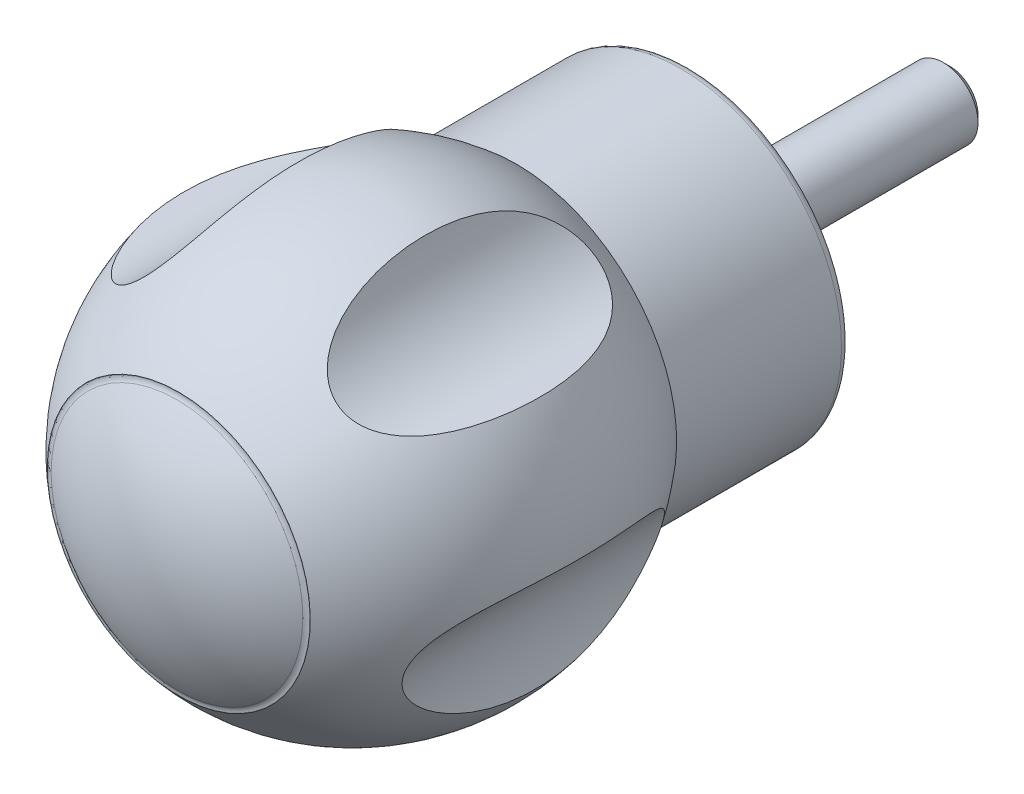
ISO-10303-21;
HEADER;
FILE_DESCRIPTION(('STEP AP214'),'2;1');
FILE_NAME('part.step','',(''),(''),'','','');
FILE_SCHEMA(('AUTOMOTIVE_DESIGN { 1 0 10303 214 1 1 1 1 }'));
ENDSEC;
DATA;
#1=APPLICATION_CONTEXT('core data for automotive mechanical design processes');
#2=APPLICATION_PROTOCOL_DEFINITION('international standard','automotive_design',2000,#1);
#3=PRODUCT_CONTEXT('',#1,'mechanical');
#4=PRODUCT('Part','Part','',(#3));
#5=PRODUCT_RELATED_PRODUCT_CATEGORY('part','',(#4));
#6=PRODUCT_DEFINITION_FORMATION('','',#4);
#7=PRODUCT_DEFINITION_CONTEXT('part definition',#1,'design');
#8=PRODUCT_DEFINITION('design','',#6,#7);
#9=PRODUCT_DEFINITION_SHAPE('','',#8);
#10=(LENGTH_UNIT() NAMED_UNIT(*) SI_UNIT(.MILLI.,.METRE.));
#11=(NAMED_UNIT(*) PLANE_ANGLE_UNIT() SI_UNIT($,.RADIAN.));
#12=(NAMED_UNIT(*) SI_UNIT($,.STERADIAN.) SOLID_ANGLE_UNIT());
#13=UNCERTAINTY_MEASURE_WITH_UNIT(LENGTH_MEASURE(1.E-05),#10,'distance_accuracy_value','');
#14=(GEOMETRIC_REPRESENTATION_CONTEXT(3) GLOBAL_UNCERTAINTY_ASSIGNED_CONTEXT((#13)) GLOBAL_UNIT_ASSIGNED_CONTEXT((#10,
#11,#12)) REPRESENTATION_CONTEXT('',''));
#15=CARTESIAN_POINT('',(0.,0.,0.));
#16=DIRECTION('',(0.,0.,1.));
#17=DIRECTION('',(1.,0.,0.));
#18=AXIS2_PLACEMENT_3D('',#15,#16,#17);
#19=CARTESIAN_POINT('',(0.,0.,0.));
#20=DIRECTION('',(0.,0.,-1.));
#21=DIRECTION('',(0.,1.,0.));
#22=AXIS2_PLACEMENT_3D('',#19,#20,#21);
#23=PLANE('',#22);
#24=CARTESIAN_POINT('',(0.,0.,0.));
#25=DIRECTION('',(0.,0.,-1.));
#26=DIRECTION('',(0.,1.,0.));
#27=AXIS2_PLACEMENT_3D('',#24,#25,#26);
#28=CIRCLE('',#27,4.);
#29=CARTESIAN_POINT('',(0.,4.,0.));
#30=VERTEX_POINT('',#29);
#31=EDGE_CURVE('E8',#30,#30,#28,.T.);
#32=ORIENTED_EDGE('',*,*,#31,.F.);
#33=EDGE_LOOP('',(#32));
#34=FACE_BOUND('',#33,.T.);
#35=CARTESIAN_POINT('',(0.,0.,0.));
#36=DIRECTION('',(0.,0.,-1.));
#37=DIRECTION('',(0.,1.,0.));
#38=AXIS2_PLACEMENT_3D('',#35,#36,#37);
#39=CIRCLE('',#38,17.5);
#40=CARTESIAN_POINT('',(0.,17.5,0.));
#41=VERTEX_POINT('',#40);
#42=EDGE_CURVE('E18',#41,#41,#39,.T.);
#43=ORIENTED_EDGE('',*,*,#42,.T.);
#44=EDGE_LOOP('',(#43));
#45=FACE_BOUND('',#44,.T.);
#46=ADVANCED_FACE('F12',(#34,#45),#23,.T.);
#47=CARTESIAN_POINT('',(0.,0.,0.999999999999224));
#48=DIRECTION('',(0.,0.,-1.));
#49=DIRECTION('',(0.,1.,0.));
#50=AXIS2_PLACEMENT_3D('',#47,#48,#49);
#51=TOROIDAL_SURFACE('',#50,17.5000000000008,0.999999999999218);
#52=CARTESIAN_POINT('',(0.,0.,1.));
#53=DIRECTION('',(0.,0.,-1.));
#54=DIRECTION('',(0.,1.,0.));
#55=AXIS2_PLACEMENT_3D('',#52,#53,#54);
#56=CIRCLE('',#55,18.5);
#57=CARTESIAN_POINT('',(0.,18.5,1.));
#58=VERTEX_POINT('',#57);
#59=EDGE_CURVE('E22',#58,#58,#56,.T.);
#60=ORIENTED_EDGE('',*,*,#59,.T.);
#61=EDGE_LOOP('',(#60));
#62=FACE_BOUND('',#61,.T.);
#63=ORIENTED_EDGE('',*,*,#42,.F.);
#64=EDGE_LOOP('',(#63));
#65=FACE_BOUND('',#64,.T.);
#66=ADVANCED_FACE('F120',(#62,#65),#51,.T.);
#67=CARTESIAN_POINT('',(0.,0.,64.));
#68=DIRECTION('',(0.,0.,-1.));
#69=DIRECTION('',(0.,1.,0.));
#70=AXIS2_PLACEMENT_3D('',#67,#68,#69);
#71=CYLINDRICAL_SURFACE('',#70,18.5);
#72=CARTESIAN_POINT('',(0.,0.,20.));
#73=DIRECTION('',(0.,0.,-1.));
#74=DIRECTION('',(0.,1.,0.));
#75=AXIS2_PLACEMENT_3D('',#72,#73,#74);
#76=CIRCLE('',#75,18.5);
#77=CARTESIAN_POINT('',(0.,18.5,20.));
#78=VERTEX_POINT('',#77);
#79=EDGE_CURVE('E27',#78,#78,#76,.T.);
#80=ORIENTED_EDGE('',*,*,#79,.T.);
#81=EDGE_LOOP('',(#80));
#82=FACE_BOUND('',#81,.T.);
#83=ORIENTED_EDGE('',*,*,#59,.F.);
#84=EDGE_LOOP('',(#83));
#85=FACE_BOUND('',#84,.T.);
#86=ADVANCED_FACE('F106',(#82,#85),#71,.T.);
#87=CARTESIAN_POINT('',(0.,0.,37.7823040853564));
#88=DIRECTION('',(0.,0.,-1.));
#89=DIRECTION('',(0.,1.,0.));
#90=AXIS2_PLACEMENT_3D('',#87,#88,#89);
#91=DEGENERATE_TOROIDAL_SURFACE('',#90,2.45981194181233,27.4867978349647,.F.);
#92=CARTESIAN_POINT('',(9.64615552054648,19.1331819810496,24.1833184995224));
#93=CARTESIAN_POINT('',(9.48345657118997,19.3402419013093,24.3794324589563));
#94=CARTESIAN_POINT('',(9.3348650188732,19.5426746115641,24.5920665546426));
#95=CARTESIAN_POINT('',(9.06234425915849,19.9357170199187,25.0428562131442));
#96=CARTESIAN_POINT('',(8.93845436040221,20.1263075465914,25.2810515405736));
#97=CARTESIAN_POINT('',(8.71118421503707,20.4952338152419,25.7786146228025));
#98=CARTESIAN_POINT('',(8.60794571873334,20.6734797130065,26.0381125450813));
#99=CARTESIAN_POINT('',(8.41968766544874,21.0155888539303,26.5724184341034));
#100=CARTESIAN_POINT('',(8.33466135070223,21.1794574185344,26.8472206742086));
#101=CARTESIAN_POINT('',(8.14928092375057,21.5544472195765,27.5198032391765));
#102=CARTESIAN_POINT('',(8.05609382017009,21.7587365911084,27.9233650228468));
#103=CARTESIAN_POINT('',(7.89274210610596,22.1392008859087,28.7480367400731));
#104=CARTESIAN_POINT('',(7.8225900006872,22.3153605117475,29.1691560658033));
#105=CARTESIAN_POINT('',(7.70040655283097,22.6396177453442,30.023843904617));
#106=CARTESIAN_POINT('',(7.64835011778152,22.787754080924,30.4573942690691));
#107=CARTESIAN_POINT('',(7.5583515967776,23.0566849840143,31.3342431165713));
#108=CARTESIAN_POINT('',(7.52040841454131,23.1774816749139,31.7775408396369));
#109=CARTESIAN_POINT('',(7.46554169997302,23.359526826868,32.5355594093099));
#110=CARTESIAN_POINT('',(7.44573424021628,23.4277178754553,32.8484350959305));
#111=CARTESIAN_POINT('',(7.41078752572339,23.5511669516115,33.4770140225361));
#112=CARTESIAN_POINT('',(7.39564860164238,23.6064240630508,33.7927174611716));
#113=CARTESIAN_POINT('',(7.36943118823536,23.7041033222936,34.4263549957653));
#114=CARTESIAN_POINT('',(7.35835379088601,23.7465220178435,34.744289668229));
#115=CARTESIAN_POINT('',(7.33982062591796,23.8185798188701,35.3817210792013));
#116=CARTESIAN_POINT('',(7.3323652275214,23.8482176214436,35.7012179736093));
#117=CARTESIAN_POINT('',(7.31489793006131,23.9181580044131,36.662895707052));
#118=CARTESIAN_POINT('',(7.30984724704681,23.9392423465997,37.3066647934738));
#119=CARTESIAN_POINT('',(7.31201499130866,23.930357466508,38.5937099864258));
#120=CARTESIAN_POINT('',(7.3192310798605,23.9003979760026,39.2369861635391));
#121=CARTESIAN_POINT('',(7.34031673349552,23.8167327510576,40.2018959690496));
#122=CARTESIAN_POINT('',(7.34913632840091,23.7820772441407,40.5253890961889));
#123=CARTESIAN_POINT('',(7.37065082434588,23.6995982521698,41.1705501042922));
#124=CARTESIAN_POINT('',(7.38334530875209,23.6517761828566,41.4922181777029));
#125=CARTESIAN_POINT('',(7.41313830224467,23.5428498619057,42.1332804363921));
#126=CARTESIAN_POINT('',(7.4302392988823,23.4817381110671,42.4526732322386));
#127=CARTESIAN_POINT('',(7.46953672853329,23.346142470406,43.0882937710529));
#128=CARTESIAN_POINT('',(7.49173305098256,23.2716588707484,43.4045215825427));
#129=CARTESIAN_POINT('',(7.54196498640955,23.1096128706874,44.0313942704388));
#130=CARTESIAN_POINT('',(7.56996980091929,23.0221201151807,44.3420595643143));
#131=CARTESIAN_POINT('',(7.63295092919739,22.8336259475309,44.9585946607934));
#132=CARTESIAN_POINT('',(7.66792784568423,22.7326233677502,45.2644640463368));
#133=CARTESIAN_POINT('',(7.74609493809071,22.5170918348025,45.8699523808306));
#134=CARTESIAN_POINT('',(7.78927572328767,22.4025784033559,46.1695780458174));
#135=CARTESIAN_POINT('',(7.88540878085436,22.1598219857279,46.7615525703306));
#136=CARTESIAN_POINT('',(7.93835812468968,22.0315831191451,47.0539035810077));
#137=CARTESIAN_POINT('',(8.04334062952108,21.7901126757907,47.568273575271));
#138=CARTESIAN_POINT('',(8.09315689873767,21.6795205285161,47.7919850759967));
#139=CARTESIAN_POINT('',(8.2010375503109,21.4497580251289,48.2329104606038));
#140=CARTESIAN_POINT('',(8.25910080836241,21.3305888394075,48.4501252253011));
#141=CARTESIAN_POINT('',(8.3847913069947,21.0834789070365,48.8772303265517));
#142=CARTESIAN_POINT('',(8.45243513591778,20.9555231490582,49.0871071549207));
#143=CARTESIAN_POINT('',(8.59858161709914,20.6911498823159,49.4975980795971));
#144=CARTESIAN_POINT('',(8.67708445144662,20.5547322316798,49.6982120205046));
#145=CARTESIAN_POINT('',(8.84769419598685,20.2716944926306,50.0910311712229));
#146=CARTESIAN_POINT('',(8.93998001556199,20.1249561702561,50.283074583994));
#147=CARTESIAN_POINT('',(9.13905119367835,19.8235620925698,50.6531080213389));
#148=CARTESIAN_POINT('',(9.24584025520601,19.6689043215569,50.831094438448));
#149=CARTESIAN_POINT('',(9.47526528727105,19.3532201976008,51.1690858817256));
#150=CARTESIAN_POINT('',(9.5978411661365,19.1922195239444,51.3291549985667));
#151=CARTESIAN_POINT('',(9.86055062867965,18.8650643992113,51.6279005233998));
#152=CARTESIAN_POINT('',(10.0006666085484,18.698915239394,51.7665980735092));
#153=CARTESIAN_POINT('',(10.3189452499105,18.3420469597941,52.034220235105));
#154=CARTESIAN_POINT('',(10.4996818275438,18.1509018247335,52.1596296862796));
#155=CARTESIAN_POINT('',(10.7882432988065,17.8653559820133,52.3173260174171));
#156=CARTESIAN_POINT('',(10.8873535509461,17.7703573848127,52.3648259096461));
#157=CARTESIAN_POINT('',(11.0911138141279,17.5814933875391,52.4488653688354));
#158=CARTESIAN_POINT('',(11.1957612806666,17.4876274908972,52.4854099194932));
#159=CARTESIAN_POINT('',(11.4109272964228,17.3011546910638,52.547029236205));
#160=CARTESIAN_POINT('',(11.5214842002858,17.2085626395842,52.5720153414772));
#161=CARTESIAN_POINT('',(11.7469624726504,17.0262974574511,52.6095383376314));
#162=CARTESIAN_POINT('',(11.8618819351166,16.9366230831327,52.6220806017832));
#163=CARTESIAN_POINT('',(12.0952129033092,16.7610112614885,52.6344332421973));
#164=CARTESIAN_POINT('',(12.213624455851,16.675073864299,52.6342434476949));
#165=CARTESIAN_POINT('',(12.4528872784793,16.5076976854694,52.6211364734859));
#166=CARTESIAN_POINT('',(12.5737384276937,16.4262586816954,52.6082199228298));
#167=CARTESIAN_POINT('',(12.8055938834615,16.2757414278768,52.5717303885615));
#168=CARTESIAN_POINT('',(12.9164810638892,16.2062153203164,52.5492472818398));
#169=CARTESIAN_POINT('',(13.1385793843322,16.0716588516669,52.4944712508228));
#170=CARTESIAN_POINT('',(13.2497906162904,16.0066299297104,52.4621752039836));
#171=CARTESIAN_POINT('',(13.5827295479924,15.8186232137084,52.3513785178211));
#172=CARTESIAN_POINT('',(13.8038861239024,15.7026457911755,52.2589490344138));
#173=CARTESIAN_POINT('',(14.320248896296,15.450110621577,52.0022092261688));
#174=CARTESIAN_POINT('',(14.6125049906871,15.3218679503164,51.8239538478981));
#175=CARTESIAN_POINT('',(15.1772253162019,15.0968616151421,51.4218619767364));
#176=CARTESIAN_POINT('',(15.4496457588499,15.0001660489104,51.1979285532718));
#177=CARTESIAN_POINT('',(15.9069492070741,14.8535028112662,50.7756127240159));
#178=CARTESIAN_POINT('',(16.0968863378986,14.7978916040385,50.5844859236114));
#179=CARTESIAN_POINT('',(16.4633333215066,14.699129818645,50.1866432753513));
#180=CARTESIAN_POINT('',(16.6398361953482,14.6559856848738,49.9799194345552));
#181=CARTESIAN_POINT('',(16.9795964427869,14.5800076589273,49.5536597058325));
#182=CARTESIAN_POINT('',(17.1428342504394,14.5471887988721,49.3341056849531));
#183=CARTESIAN_POINT('',(17.4561371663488,14.4900636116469,48.8846930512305));
#184=CARTESIAN_POINT('',(17.6061977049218,14.465760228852,48.6548309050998));
#185=CARTESIAN_POINT('',(17.9868742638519,14.4104834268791,48.0345307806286));
#186=CARTESIAN_POINT('',(18.2064910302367,14.3854339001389,47.6367866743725));
#187=CARTESIAN_POINT('',(18.6128643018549,14.3481661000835,46.824233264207));
#188=CARTESIAN_POINT('',(18.7996003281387,14.3359557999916,46.4094135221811));
#189=CARTESIAN_POINT('',(19.1421520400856,14.3198933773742,45.5664949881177));
#190=CARTESIAN_POINT('',(19.2979273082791,14.3160521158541,45.1383796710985));
#191=CARTESIAN_POINT('',(19.5797908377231,14.3133116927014,44.2725635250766));
#192=CARTESIAN_POINT('',(19.7058818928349,14.3144120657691,43.8348636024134));
#193=CARTESIAN_POINT('',(19.8965253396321,14.3182934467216,43.0829226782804));
#194=CARTESIAN_POINT('',(19.9682474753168,14.3204809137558,42.7704677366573));
#195=CARTESIAN_POINT('',(20.0979520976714,14.3253342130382,42.1426951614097));
#196=CARTESIAN_POINT('',(20.1559336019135,14.3280000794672,41.8273773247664));
#197=CARTESIAN_POINT('',(20.2584423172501,14.3332555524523,41.1944730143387));
#198=CARTESIAN_POINT('',(20.3029657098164,14.3358451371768,40.8768859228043));
#199=CARTESIAN_POINT('',(20.3787485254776,14.3405408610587,40.2401174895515));
#200=CARTESIAN_POINT('',(20.4100065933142,14.3426469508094,39.9209359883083));
#201=CARTESIAN_POINT('',(20.4842130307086,14.3477811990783,38.9605812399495));
#202=CARTESIAN_POINT('',(20.5074047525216,14.3496131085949,38.3177751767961));
#203=CARTESIAN_POINT('',(20.5015908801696,14.3491769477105,37.0325236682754));
#204=CARTESIAN_POINT('',(20.4725953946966,14.3469096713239,36.3900781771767));
#205=CARTESIAN_POINT('',(20.3892363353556,14.3412565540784,35.4261568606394));
#206=CARTESIAN_POINT('',(20.3544771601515,14.33897637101,35.1028822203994));
#207=CARTESIAN_POINT('',(20.2712780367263,14.3340068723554,34.4581139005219));
#208=CARTESIAN_POINT('',(20.2228395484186,14.331317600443,34.1366200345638));
#209=CARTESIAN_POINT('',(20.1120162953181,14.3259866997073,33.4958601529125));
#210=CARTESIAN_POINT('',(20.0496237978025,14.3233450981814,33.1765954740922));
#211=CARTESIAN_POINT('',(19.9105983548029,14.3187268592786,32.5411744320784));
#212=CARTESIAN_POINT('',(19.8339657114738,14.3167502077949,32.2250180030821));
#213=CARTESIAN_POINT('',(19.6664947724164,14.3142459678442,31.59816542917));
#214=CARTESIAN_POINT('',(19.5757293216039,14.3137111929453,31.2874499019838));
#215=CARTESIAN_POINT('',(19.3792557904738,14.3150195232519,30.6707388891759));
#216=CARTESIAN_POINT('',(19.2735464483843,14.3168628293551,30.364743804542));
#217=CARTESIAN_POINT('',(19.0467867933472,14.3240841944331,29.7589039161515));
#218=CARTESIAN_POINT('',(18.9257536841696,14.3294583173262,29.4590526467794));
#219=CARTESIAN_POINT('',(18.667680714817,14.3451379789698,28.866510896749));
#220=CARTESIAN_POINT('',(18.5306455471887,14.3554420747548,28.5738183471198));
#221=CARTESIAN_POINT('',(18.2698206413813,14.3798794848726,28.0565192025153));
#222=CARTESIAN_POINT('',(18.1491118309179,14.3927877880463,27.8303006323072));
#223=CARTESIAN_POINT('',(17.8968255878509,14.4237999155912,27.3843837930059));
#224=CARTESIAN_POINT('',(17.7652496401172,14.4419030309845,27.1646846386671));
#225=CARTESIAN_POINT('',(17.4906228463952,14.4845139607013,26.7326331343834));
#226=CARTESIAN_POINT('',(17.3475519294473,14.5090331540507,26.5202946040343));
#227=CARTESIAN_POINT('',(17.0498212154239,14.5658261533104,26.1049313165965));
#228=CARTESIAN_POINT('',(16.8951612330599,14.5981000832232,25.9019067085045));
#229=CARTESIAN_POINT('',(16.5716975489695,14.6725075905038,25.5042749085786));
#230=CARTESIAN_POINT('',(16.4027212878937,14.7147773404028,25.3098324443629));
#231=CARTESIAN_POINT('',(16.0525323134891,14.8107759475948,24.9351177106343));
#232=CARTESIAN_POINT('',(15.8713163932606,14.8645078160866,24.7548491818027));
#233=CARTESIAN_POINT('',(15.4977153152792,14.9852344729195,24.4124922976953));
#234=CARTESIAN_POINT('',(15.3053750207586,15.0521783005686,24.2503377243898));
#235=CARTESIAN_POINT('',(14.9101396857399,15.2013886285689,23.9476798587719));
#236=CARTESIAN_POINT('',(14.7072556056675,15.2836394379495,23.8071546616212));
#237=CARTESIAN_POINT('',(14.2677894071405,15.4762585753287,23.5371657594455));
#238=CARTESIAN_POINT('',(14.0300690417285,15.5888074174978,23.4110046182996));
#239=CARTESIAN_POINT('',(13.6691228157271,15.7746252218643,23.2521491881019));
#240=CARTESIAN_POINT('',(13.5480644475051,15.839406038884,23.204257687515));
#241=CARTESIAN_POINT('',(13.3052834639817,15.9746013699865,23.1194301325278));
#242=CARTESIAN_POINT('',(13.1835611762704,16.0450133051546,23.0824890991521));
#243=CARTESIAN_POINT('',(12.9394612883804,16.1918335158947,23.0200747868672));
#244=CARTESIAN_POINT('',(12.8170857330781,16.2682832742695,22.9946907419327));
#245=CARTESIAN_POINT('',(12.5737336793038,16.4262595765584,22.9563831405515));
#246=CARTESIAN_POINT('',(12.4527565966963,16.5077839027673,22.9434541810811));
#247=CARTESIAN_POINT('',(12.2132400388,16.6753479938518,22.9303540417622));
#248=CARTESIAN_POINT('',(12.0947006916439,16.761387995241,22.9301835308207));
#249=CARTESIAN_POINT('',(11.8611503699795,16.937182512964,22.9425849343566));
#250=CARTESIAN_POINT('',(11.7461391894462,17.026936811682,22.955156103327));
#251=CARTESIAN_POINT('',(11.4286566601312,17.2836473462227,23.0081332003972));
#252=CARTESIAN_POINT('',(11.2311540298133,17.4540059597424,23.0628637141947));
#253=CARTESIAN_POINT('',(10.8547688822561,17.798819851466,23.2095558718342));
#254=CARTESIAN_POINT('',(10.6758911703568,17.9732761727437,23.3015270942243));
#255=CARTESIAN_POINT('',(10.3454340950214,18.3141897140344,23.5125503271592));
#256=CARTESIAN_POINT('',(10.1930118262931,18.4806684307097,23.6302683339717));
#257=CARTESIAN_POINT('',(9.9063000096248,18.8100812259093,23.8898050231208));
#258=CARTESIAN_POINT('',(9.77200724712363,18.9730159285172,24.0316194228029));
#259=CARTESIAN_POINT('',(9.64615552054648,19.1331819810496,24.1833184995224));
#260=B_SPLINE_CURVE_WITH_KNOTS('',3,(#92,#93,#94,#95,#96,#97,#98,#99,#100,#101,#102,#103,#104,
#105,#106,#107,#108,#109,#110,#111,#112,#113,#114,#115,#116,#117,#118,#119,#120,#121,#122,#123,
#124,#125,#126,#127,#128,#129,#130,#131,#132,#133,#134,#135,#136,#137,#138,#139,#140,#141,#142,
#143,#144,#145,#146,#147,#148,#149,#150,#151,#152,#153,#154,#155,#156,#157,#158,#159,#160,#161,
#162,#163,#164,#165,#166,#167,#168,#169,#170,#171,#172,#173,#174,#175,#176,#177,#178,#179,#180,
#181,#182,#183,#184,#185,#186,#187,#188,#189,#190,#191,#192,#193,#194,#195,#196,#197,#198,#199,
#200,#201,#202,#203,#204,#205,#206,#207,#208,#209,#210,#211,#212,#213,#214,#215,#216,#217,#218,
#219,#220,#221,#222,#223,#224,#225,#226,#227,#228,#229,#230,#231,#232,#233,#234,#235,#236,#237,
#238,#239,#240,#241,#242,#243,#244,#245,#246,#247,#248,#249,#250,#251,#252,#253,#254,#255,#256,
#257,#258,#259),.UNSPECIFIED.,.T.,.F.,(4,2,2,2,2,2,2,2,2,2,2,2,2,2,2,2,2,2,2,2,2,2,2,2,2,2,2,2,
2,2,2,2,2,2,2,2,2,2,2,2,2,2,2,2,2,2,2,2,2,2,2,2,2,2,2,2,2,2,2,2,2,2,2,2,2,2,2,2,2,2,2,2,2,2,2,2,
2,2,2,2,2,2,2,4),(0.,0.984470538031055,1.97049541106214,2.96307211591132,3.95527987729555,
5.33855218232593,6.72257419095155,8.10466929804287,9.4866570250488,10.4488665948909,
11.4111442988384,12.3736805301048,13.3363148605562,15.2664246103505,17.1961664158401,
18.1723123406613,19.1483533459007,20.1249465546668,21.1015185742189,22.07303913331,
23.0446437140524,24.0151427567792,24.9853513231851,25.7484674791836,26.5114796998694,
27.2758295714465,28.0401922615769,28.8155138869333,29.5910338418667,30.3636845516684,
31.1355659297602,32.0061083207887,32.4414898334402,32.8766729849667,33.3151410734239,
33.7534197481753,34.1917043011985,34.6299671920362,35.0279045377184,35.4259686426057,
36.2216565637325,37.3123882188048,38.4054589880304,39.22976871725,40.0545037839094,
40.8804340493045,41.7066496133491,43.0696147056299,44.4334257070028,45.7990055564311,
47.1644568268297,48.1259320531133,49.0874760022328,50.0492925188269,51.0112072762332,
52.9386033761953,54.8656261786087,55.8408202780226,56.815910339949,57.7915421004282,
58.7671531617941,59.7378926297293,60.7087141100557,61.678455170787,62.6479125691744,
63.417790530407,64.1875634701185,64.9587109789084,65.7298708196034,66.5122118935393,
67.2947587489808,68.0743441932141,68.8531348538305,69.7245362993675,70.1603455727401,
70.5959563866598,71.0348758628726,71.4736048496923,71.9123568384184,72.3510831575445,
73.1467362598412,73.9425941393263,74.7042420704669,75.4657547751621),.UNSPECIFIED.);
#261=CARTESIAN_POINT('',(9.64615552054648,19.1331819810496,24.1833184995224));
#262=VERTEX_POINT('',#261);
#263=EDGE_CURVE('E83',#262,#262,#260,.T.);
#264=ORIENTED_EDGE('',*,*,#263,.F.);
#265=EDGE_LOOP('',(#264));
#266=FACE_BOUND('',#265,.T.);
#267=CARTESIAN_POINT('',(19.0721852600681,-11.1680952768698,25.4426161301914));
#268=CARTESIAN_POINT('',(19.0623640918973,-11.0283355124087,25.2851801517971));
#269=CARTESIAN_POINT('',(19.0545384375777,-10.8837357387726,25.1318868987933));
#270=CARTESIAN_POINT('',(19.0438547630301,-10.5846503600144,24.8351316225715));
#271=CARTESIAN_POINT('',(19.0409972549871,-10.4301637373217,24.691670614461));
#272=CARTESIAN_POINT('',(19.0415090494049,-9.95209015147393,24.2791378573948));
#273=CARTESIAN_POINT('',(19.0538954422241,-9.61310588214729,24.0270115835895));
#274=CARTESIAN_POINT('',(19.1041865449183,-8.99900634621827,23.6497700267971));
#275=CARTESIAN_POINT('',(19.1338737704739,-8.73297996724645,23.5089050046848));
#276=CARTESIAN_POINT('',(19.1938752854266,-8.32262867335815,23.3287295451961));
#277=CARTESIAN_POINT('',(19.2164603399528,-8.18393056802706,23.2738501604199));
#278=CARTESIAN_POINT('',(19.267080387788,-7.90355872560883,23.1754616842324));
#279=CARTESIAN_POINT('',(19.2951129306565,-7.76188635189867,23.1319475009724));
#280=CARTESIAN_POINT('',(19.357082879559,-7.47527231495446,23.0568566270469));
#281=CARTESIAN_POINT('',(19.3910701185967,-7.33031284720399,23.0253884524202));
#282=CARTESIAN_POINT('',(19.4647864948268,-7.03957276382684,22.9756795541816));
#283=CARTESIAN_POINT('',(19.5045155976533,-6.89379215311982,22.9574387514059));
#284=CARTESIAN_POINT('',(19.5895057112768,-6.60284514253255,22.9346551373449));
#285=CARTESIAN_POINT('',(19.6347640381,-6.45767847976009,22.9301057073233));
#286=CARTESIAN_POINT('',(19.7304375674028,-6.16929121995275,22.9348062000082));
#287=CARTESIAN_POINT('',(19.780852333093,-6.02607045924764,22.9440549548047));
#288=CARTESIAN_POINT('',(19.8798541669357,-5.76014382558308,22.9741532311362));
#289=CARTESIAN_POINT('',(19.9279160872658,-5.63706374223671,22.9934527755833));
#290=CARTESIAN_POINT('',(20.0271323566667,-5.39416709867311,23.0421227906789));
#291=CARTESIAN_POINT('',(20.0782876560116,-5.27435155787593,23.0714963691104));
#292=CARTESIAN_POINT('',(20.2356369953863,-4.92085237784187,23.1739727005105));
#293=CARTESIAN_POINT('',(20.3457684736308,-4.6929725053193,23.2614481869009));
#294=CARTESIAN_POINT('',(20.6101862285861,-4.18352994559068,23.5040625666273));
#295=CARTESIAN_POINT('',(20.7669386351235,-3.90944430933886,23.6720412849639));
#296=CARTESIAN_POINT('',(21.0837421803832,-3.39692062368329,24.0533196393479));
#297=CARTESIAN_POINT('',(21.2437993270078,-3.15855548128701,24.266709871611));
#298=CARTESIAN_POINT('',(21.5210545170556,-2.77180192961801,24.6689738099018));
#299=CARTESIAN_POINT('',(21.6388543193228,-2.61590410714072,24.8503989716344));
#300=CARTESIAN_POINT('',(21.8714595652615,-2.32137372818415,25.2286598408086));
#301=CARTESIAN_POINT('',(21.9862634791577,-2.18274986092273,25.4255032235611));
#302=CARTESIAN_POINT('',(22.2117703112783,-1.92107852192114,25.8319054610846));
#303=CARTESIAN_POINT('',(22.3224670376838,-1.79805394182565,26.0414823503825));
#304=CARTESIAN_POINT('',(22.538766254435,-1.5662031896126,26.4709068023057));
#305=CARTESIAN_POINT('',(22.6443669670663,-1.45738195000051,26.6907578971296));
#306=CARTESIAN_POINT('',(22.9164150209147,-1.18608106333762,27.2841896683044));
#307=CARTESIAN_POINT('',(23.0779389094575,-1.03453662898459,27.6650536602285));
#308=CARTESIAN_POINT('',(23.3834716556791,-0.76045920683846,28.4439005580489));
#309=CARTESIAN_POINT('',(23.5274695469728,-0.637944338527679,28.8418939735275));
#310=CARTESIAN_POINT('',(23.7968925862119,-0.417328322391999,29.6513113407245));
#311=CARTESIAN_POINT('',(23.9222912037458,-0.31926191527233,30.0627534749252));
#312=CARTESIAN_POINT('',(24.1534746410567,-0.144173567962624,30.8954130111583));
#313=CARTESIAN_POINT('',(24.2592612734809,-0.0671496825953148,31.3166295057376));
#314=CARTESIAN_POINT('',(24.4238467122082,0.0496019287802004,32.047227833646));
#315=CARTESIAN_POINT('',(24.4875023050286,0.0937309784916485,32.3548380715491));
#316=CARTESIAN_POINT('',(24.6042630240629,0.173368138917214,32.973190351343));
#317=CARTESIAN_POINT('',(24.6573673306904,0.208875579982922,33.2839326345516));
#318=CARTESIAN_POINT('',(24.7529207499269,0.271939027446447,33.9079408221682));
#319=CARTESIAN_POINT('',(24.7953666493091,0.29949263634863,34.2212074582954));
#320=CARTESIAN_POINT('',(24.8695059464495,0.347151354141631,34.849603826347));
#321=CARTESIAN_POINT('',(24.9011982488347,0.367255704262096,35.1647337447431));
#322=CARTESIAN_POINT('',(24.9538094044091,0.4004149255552,35.7967783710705));
#323=CARTESIAN_POINT('',(24.9747105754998,0.41345822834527,36.1136951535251));
#324=CARTESIAN_POINT('',(25.0056258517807,0.432690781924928,36.7482953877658));
#325=CARTESIAN_POINT('',(25.0156389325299,0.438879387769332,37.0659789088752));
#326=CARTESIAN_POINT('',(25.0247561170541,0.444515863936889,37.701486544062));
#327=CARTESIAN_POINT('',(25.0238628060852,0.443965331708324,38.0193106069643));
#328=CARTESIAN_POINT('',(25.0111750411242,0.436117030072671,38.6546576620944));
#329=CARTESIAN_POINT('',(24.9993805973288,0.4288192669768,38.9721806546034));
#330=CARTESIAN_POINT('',(24.9646664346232,0.407187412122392,39.6109021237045));
#331=CARTESIAN_POINT('',(24.9415913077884,0.392754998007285,39.9320888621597));
#332=CARTESIAN_POINT('',(24.8842948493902,0.35653347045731,40.5730139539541));
#333=CARTESIAN_POINT('',(24.8500748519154,0.334745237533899,40.8927524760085));
#334=CARTESIAN_POINT('',(24.770531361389,0.28337778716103,41.5303953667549));
#335=CARTESIAN_POINT('',(24.7252019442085,0.253794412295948,41.8482986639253));
#336=CARTESIAN_POINT('',(24.6235459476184,0.186275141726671,42.4814152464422));
#337=CARTESIAN_POINT('',(24.5672207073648,0.148340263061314,42.7966288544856));
#338=CARTESIAN_POINT('',(24.4439137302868,0.0635358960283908,43.4225619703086));
#339=CARTESIAN_POINT('',(24.3769710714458,0.0166990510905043,43.7332935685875));
#340=CARTESIAN_POINT('',(24.2324546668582,-0.0868896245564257,44.3505654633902));
#341=CARTESIAN_POINT('',(24.154882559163,-0.143639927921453,44.657106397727));
#342=CARTESIAN_POINT('',(23.9893767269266,-0.268104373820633,45.264857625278));
#343=CARTESIAN_POINT('',(23.9014515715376,-0.335809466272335,45.5660720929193));
#344=CARTESIAN_POINT('',(23.7154832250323,-0.483512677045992,46.1622480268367));
#345=CARTESIAN_POINT('',(23.6174424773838,-0.563507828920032,46.45721098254));
#346=CARTESIAN_POINT('',(23.4257259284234,-0.725434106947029,46.9996108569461));
#347=CARTESIAN_POINT('',(23.3332965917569,-0.80559397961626,47.248016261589));
#348=CARTESIAN_POINT('',(23.1414992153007,-0.977402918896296,47.738084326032));
#349=CARTESIAN_POINT('',(23.042131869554,-1.0690508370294,47.9797476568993));
#350=CARTESIAN_POINT('',(22.836865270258,-1.2651914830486,48.4550245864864));
#351=CARTESIAN_POINT('',(22.7309652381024,-1.36968574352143,48.6886372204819));
#352=CARTESIAN_POINT('',(22.5132257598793,-1.5930227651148,49.1460594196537));
#353=CARTESIAN_POINT('',(22.4013870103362,-1.71186384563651,49.3698701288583));
#354=CARTESIAN_POINT('',(22.1901963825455,-1.94603320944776,49.771941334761));
#355=CARTESIAN_POINT('',(22.0915743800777,-2.05908329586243,49.9519081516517));
#356=CARTESIAN_POINT('',(21.8912959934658,-2.29775849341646,50.3016081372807));
#357=CARTESIAN_POINT('',(21.7896393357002,-2.42338474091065,50.4713403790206));
#358=CARTESIAN_POINT('',(21.5843567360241,-2.68806499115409,50.7981776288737));
#359=CARTESIAN_POINT('',(21.4807348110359,-2.82709356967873,50.9553055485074));
#360=CARTESIAN_POINT('',(21.2725598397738,-3.11965882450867,51.2546655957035));
#361=CARTESIAN_POINT('',(21.1680069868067,-3.27319254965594,51.3969007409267));
#362=CARTESIAN_POINT('',(20.9242857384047,-3.64993770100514,51.7083703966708));
#363=CARTESIAN_POINT('',(20.7852831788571,-3.87923401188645,51.8706322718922));
#364=CARTESIAN_POINT('',(20.581320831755,-4.24337798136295,52.08338385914));
#365=CARTESIAN_POINT('',(20.5140777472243,-4.36815194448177,52.1492039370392));
#366=CARTESIAN_POINT('',(20.3818256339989,-4.62414700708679,52.2695153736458));
#367=CARTESIAN_POINT('',(20.3168154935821,-4.75536481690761,52.3240124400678));
#368=CARTESIAN_POINT('',(20.1891131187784,-5.02518084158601,52.4211148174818));
#369=CARTESIAN_POINT('',(20.1264539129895,-5.1638439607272,52.4635838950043));
#370=CARTESIAN_POINT('',(20.0050835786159,-5.44625718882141,52.5348095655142));
#371=CARTESIAN_POINT('',(19.9463703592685,-5.5900045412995,52.5635734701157));
#372=CARTESIAN_POINT('',(19.8336837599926,-5.88139098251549,52.6066569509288));
#373=CARTESIAN_POINT('',(19.779707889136,-6.02902797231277,52.6209841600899));
#374=CARTESIAN_POINT('',(19.6771442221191,-6.32683662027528,52.6348208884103));
#375=CARTESIAN_POINT('',(19.6285557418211,-6.47700795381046,52.6343322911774));
#376=CARTESIAN_POINT('',(19.5436532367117,-6.75723229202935,52.6196633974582));
#377=CARTESIAN_POINT('',(19.5065731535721,-6.88715799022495,52.607409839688));
#378=CARTESIAN_POINT('',(19.4369248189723,-7.14678746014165,52.5722284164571));
#379=CARTESIAN_POINT('',(19.4043578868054,-7.27649115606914,52.5492974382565));
#380=CARTESIAN_POINT('',(19.3135579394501,-7.66382691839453,52.4651006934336));
#381=CARTESIAN_POINT('',(19.2621768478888,-7.91984661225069,52.3884218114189));
#382=CARTESIAN_POINT('',(19.1660350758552,-8.48522658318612,52.1749375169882));
#383=CARTESIAN_POINT('',(19.1263358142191,-8.79146523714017,52.027765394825));
#384=CARTESIAN_POINT('',(19.0700867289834,-9.38041135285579,51.6886082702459));
#385=CARTESIAN_POINT('',(19.0535777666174,-9.66307645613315,51.4965448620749));
#386=CARTESIAN_POINT('',(19.0405665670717,-10.1295722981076,51.1346277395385));
#387=CARTESIAN_POINT('',(19.0398828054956,-10.3195626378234,50.9726561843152));
#388=CARTESIAN_POINT('',(19.0462252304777,-10.6856064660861,50.6336861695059));
#389=CARTESIAN_POINT('',(19.0532550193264,-10.8616534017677,50.4566807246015));
#390=CARTESIAN_POINT('',(19.0733427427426,-11.2002791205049,50.0901686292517));
#391=CARTESIAN_POINT('',(19.0864092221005,-11.3628384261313,49.9006445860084));
#392=CARTESIAN_POINT('',(19.117108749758,-11.6748367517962,49.5114023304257));
#393=CARTESIAN_POINT('',(19.1347433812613,-11.8242711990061,49.3116806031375));
#394=CARTESIAN_POINT('',(19.1856441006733,-12.202226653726,48.7733353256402));
#395=CARTESIAN_POINT('',(19.2216949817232,-12.4202162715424,48.4275565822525));
#396=CARTESIAN_POINT('',(19.2981940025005,-12.825499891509,47.7188879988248));
#397=CARTESIAN_POINT('',(19.3386448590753,-13.0127747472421,47.3559876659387));
#398=CARTESIAN_POINT('',(19.4206221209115,-13.35943497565,46.6165314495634));
#399=CARTESIAN_POINT('',(19.4621502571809,-13.5187718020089,46.2399531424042));
#400=CARTESIAN_POINT('',(19.5435868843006,-13.8113796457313,45.4767269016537));
#401=CARTESIAN_POINT('',(19.5834955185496,-13.9446529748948,45.0900798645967));
#402=CARTESIAN_POINT('',(19.6501579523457,-14.1566882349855,44.4066290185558));
#403=CARTESIAN_POINT('',(19.6777064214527,-14.2407488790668,44.1115260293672));
#404=CARTESIAN_POINT('',(19.7300953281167,-14.3958988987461,43.5176637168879));
#405=CARTESIAN_POINT('',(19.7549355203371,-14.4669870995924,43.2189040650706));
#406=CARTESIAN_POINT('',(19.8013565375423,-14.5967402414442,42.6183481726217));
#407=CARTESIAN_POINT('',(19.8229362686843,-14.6554010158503,42.3165509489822));
#408=CARTESIAN_POINT('',(19.8623907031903,-14.7607054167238,41.7106150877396));
#409=CARTESIAN_POINT('',(19.8802650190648,-14.8073477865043,41.4064762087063));
#410=CARTESIAN_POINT('',(19.9277972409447,-14.9298115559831,40.4911627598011));
#411=CARTESIAN_POINT('',(19.9513523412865,-14.9881373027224,39.877243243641));
#412=CARTESIAN_POINT('',(19.980434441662,-15.0598279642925,38.6464982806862));
#413=CARTESIAN_POINT('',(19.98596455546,-15.0732006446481,38.0296733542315));
#414=CARTESIAN_POINT('',(19.9804674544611,-15.059744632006,37.0990523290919));
#415=CARTESIAN_POINT('',(19.9762262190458,-15.0494054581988,36.7848898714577));
#416=CARTESIAN_POINT('',(19.9630675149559,-15.0170456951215,36.1572728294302));
#417=CARTESIAN_POINT('',(19.9541504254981,-14.9950260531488,35.8438181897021));
#418=CARTESIAN_POINT('',(19.9317957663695,-14.9391344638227,35.2180253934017));
#419=CARTESIAN_POINT('',(19.9183566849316,-14.9052585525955,34.9056876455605));
#420=CARTESIAN_POINT('',(19.8872163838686,-14.8254014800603,34.2828052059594));
#421=CARTESIAN_POINT('',(19.8695156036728,-14.7794215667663,33.9722603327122));
#422=CARTESIAN_POINT('',(19.8301819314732,-14.6749485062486,33.3531945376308));
#423=CARTESIAN_POINT('',(19.8085449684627,-14.6164423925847,33.0446760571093));
#424=CARTESIAN_POINT('',(19.7618132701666,-14.4864993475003,32.4306708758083));
#425=CARTESIAN_POINT('',(19.7367189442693,-14.4150639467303,32.1251838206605));
#426=CARTESIAN_POINT('',(19.6836570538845,-14.2587267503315,31.5180455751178));
#427=CARTESIAN_POINT('',(19.6556906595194,-14.1738304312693,31.2163928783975));
#428=CARTESIAN_POINT('',(19.5975967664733,-13.9898887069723,30.6176812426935));
#429=CARTESIAN_POINT('',(19.5674694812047,-13.8908446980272,30.3206218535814));
#430=CARTESIAN_POINT('',(19.4931147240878,-13.633529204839,29.6097093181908));
#431=CARTESIAN_POINT('',(19.4482286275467,-13.4677451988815,29.1985987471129));
#432=CARTESIAN_POINT('',(19.3589486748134,-13.1034501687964,28.3908356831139));
#433=CARTESIAN_POINT('',(19.3145550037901,-12.9049272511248,27.9941885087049));
#434=CARTESIAN_POINT('',(19.2306273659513,-12.4728645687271,27.2220747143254));
#435=CARTESIAN_POINT('',(19.1910708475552,-12.2394995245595,26.8465145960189));
#436=CARTESIAN_POINT('',(19.1394074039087,-11.8602414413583,26.3032059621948));
#437=CARTESIAN_POINT('',(19.1234698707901,-11.7290145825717,26.1255117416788));
#438=CARTESIAN_POINT('',(19.0950168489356,-11.4563347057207,25.7778951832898));
#439=CARTESIAN_POINT('',(19.0825004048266,-11.3148845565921,25.6079706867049));
#440=CARTESIAN_POINT('',(19.0721852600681,-11.1680952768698,25.4426161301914));
#441=B_SPLINE_CURVE_WITH_KNOTS('',3,(#267,#268,#269,#270,#271,#272,#273,#274,#275,#276,#277,
#278,#279,#280,#281,#282,#283,#284,#285,#286,#287,#288,#289,#290,#291,#292,#293,#294,#295,#296,
#297,#298,#299,#300,#301,#302,#303,#304,#305,#306,#307,#308,#309,#310,#311,#312,#313,#314,#315,
#316,#317,#318,#319,#320,#321,#322,#323,#324,#325,#326,#327,#328,#329,#330,#331,#332,#333,#334,
#335,#336,#337,#338,#339,#340,#341,#342,#343,#344,#345,#346,#347,#348,#349,#350,#351,#352,#353,
#354,#355,#356,#357,#358,#359,#360,#361,#362,#363,#364,#365,#366,#367,#368,#369,#370,#371,#372,
#373,#374,#375,#376,#377,#378,#379,#380,#381,#382,#383,#384,#385,#386,#387,#388,#389,#390,#391,
#392,#393,#394,#395,#396,#397,#398,#399,#400,#401,#402,#403,#404,#405,#406,#407,#408,#409,#410,
#411,#412,#413,#414,#415,#416,#417,#418,#419,#420,#421,#422,#423,#424,#425,#426,#427,#428,#429,
#430,#431,#432,#433,#434,#435,#436,#437,#438,#439,#440),.UNSPECIFIED.,.T.,.F.,(4,2,2,2,2,2,2,2,
2,2,2,2,2,2,2,2,2,2,2,2,2,2,2,2,2,2,2,2,2,2,2,2,2,2,2,2,2,2,2,2,2,2,2,2,2,2,2,2,2,2,2,2,2,2,2,2,
2,2,2,2,2,2,2,2,2,2,2,2,2,2,2,2,2,2,2,2,2,2,2,2,2,2,2,2,2,2,4),(0.,0.632111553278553,
1.26428826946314,2.52507796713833,3.42891741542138,3.88101915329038,4.33291799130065,
4.78879696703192,5.24467321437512,5.70032904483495,6.15594630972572,6.55607609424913,
6.95632942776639,7.75637833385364,8.82352779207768,9.89282651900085,10.6916909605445,
11.4909556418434,12.2913799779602,13.0920815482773,14.4117420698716,15.732224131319,
17.0545720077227,18.3767976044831,19.3281410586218,20.2795583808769,21.2312621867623,
22.183062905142,23.1364183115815,24.0898634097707,25.0430825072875,25.9963007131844,
26.9630375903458,27.9296587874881,28.8967965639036,29.8638166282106,30.8273567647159,
31.7907485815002,32.7533485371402,33.7157165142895,34.5460547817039,35.3763101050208,
36.2066645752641,37.0369218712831,37.7393011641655,38.4417439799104,39.1428795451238,
39.8438727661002,40.7802631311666,41.2486393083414,41.7167788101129,42.1900259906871,
42.6630204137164,43.1357646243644,43.6084487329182,44.0149459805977,44.4215618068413,
45.2342888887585,46.2550563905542,47.2776202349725,48.0256360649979,48.7740013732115,
49.5234292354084,50.2731171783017,51.5021937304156,52.732033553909,53.9639896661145,
55.1958364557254,56.1197669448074,57.0437810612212,57.9681044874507,58.8925245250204,
60.741830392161,62.5908167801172,63.5336888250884,64.4764844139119,65.4195955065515,
66.3626093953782,67.3066042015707,68.2504873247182,69.1939874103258,70.1373944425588,
71.4726853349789,72.8084623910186,74.1377530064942,74.8018436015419,75.4657485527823),.UNSPECIFIED.);
#442=CARTESIAN_POINT('',(19.0721852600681,-11.1680952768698,25.4426161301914));
#443=VERTEX_POINT('',#442);
#444=EDGE_CURVE('E78',#443,#443,#441,.T.);
#445=ORIENTED_EDGE('',*,*,#444,.F.);
#446=EDGE_LOOP('',(#445));
#447=FACE_BOUND('',#446,.T.);
#448=CARTESIAN_POINT('',(-4.39828338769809,-21.4619120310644,25.0647607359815));
#449=CARTESIAN_POINT('',(-4.14449352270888,-21.367454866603,24.7898352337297));
#450=CARTESIAN_POINT('',(-3.87234979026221,-21.2754235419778,24.5306716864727));
#451=CARTESIAN_POINT('',(-3.28916050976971,-21.1027408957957,24.0558665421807));
#452=CARTESIAN_POINT('',(-2.97817789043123,-21.022071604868,23.8401559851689));
#453=CARTESIAN_POINT('',(-2.39618792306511,-20.8970859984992,23.511441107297));
#454=CARTESIAN_POINT('',(-2.13308420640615,-20.8486836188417,23.3862121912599));
#455=CARTESIAN_POINT('',(-1.72478466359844,-20.7877529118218,23.2299049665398));
#456=CARTESIAN_POINT('',(-1.58639019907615,-20.7693863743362,23.1830541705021));
#457=CARTESIAN_POINT('',(-1.30578935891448,-20.7369971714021,23.1007222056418));
#458=CARTESIAN_POINT('',(-1.16358469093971,-20.7229725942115,23.0652360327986));
#459=CARTESIAN_POINT('',(-0.875236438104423,-20.6995730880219,23.0061634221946));
#460=CARTESIAN_POINT('',(-0.72907151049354,-20.6902332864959,22.9826668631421));
#461=CARTESIAN_POINT('',(-0.435003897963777,-20.6766460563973,22.9485202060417));
#462=CARTESIAN_POINT('',(-0.287101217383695,-20.672398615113,22.937870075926));
#463=CARTESIAN_POINT('',(0.00909543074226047,-20.6691336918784,22.9296815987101));
#464=CARTESIAN_POINT('',(0.157389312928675,-20.6701151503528,22.9321405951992));
#465=CARTESIAN_POINT('',(0.453048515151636,-20.6772736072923,22.9501025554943));
#466=CARTESIAN_POINT('',(0.600413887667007,-20.6834503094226,22.9656047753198));
#467=CARTESIAN_POINT('',(0.877539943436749,-20.6998880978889,23.006973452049));
#468=CARTESIAN_POINT('',(1.0075211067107,-20.709650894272,23.0315773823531));
#469=CARTESIAN_POINT('',(1.26494567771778,-20.732938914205,23.0904648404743));
#470=CARTESIAN_POINT('',(1.39238828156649,-20.7464653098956,23.1247513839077));
#471=CARTESIAN_POINT('',(1.76979609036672,-20.7922458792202,23.241284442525));
#472=CARTESIAN_POINT('',(2.01499230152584,-20.8297109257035,23.3372278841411));
#473=CARTESIAN_POINT('',(2.58178370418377,-20.9325649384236,23.6040279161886));
#474=CARTESIAN_POINT('',(2.89547736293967,-21.0031408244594,23.789506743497));
#475=CARTESIAN_POINT('',(3.48720697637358,-21.1578890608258,24.2062262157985));
#476=CARTESIAN_POINT('',(3.76516235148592,-21.2420912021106,24.4375673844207));
#477=CARTESIAN_POINT('',(4.22311572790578,-21.3963650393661,24.874007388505));
#478=CARTESIAN_POINT('',(4.4105712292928,-21.4649470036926,25.0719791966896));
#479=CARTESIAN_POINT('',(4.76670581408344,-21.6040763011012,25.4836324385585));
#480=CARTESIAN_POINT('',(4.93537497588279,-21.6746246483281,25.6973220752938));
#481=CARTESIAN_POINT('',(5.25545315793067,-21.8160142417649,26.137580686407));
#482=CARTESIAN_POINT('',(5.40683664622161,-21.8868557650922,26.3641679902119));
#483=CARTESIAN_POINT('',(5.6935353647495,-22.0273909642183,26.8276693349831));
#484=CARTESIAN_POINT('',(5.82884504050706,-22.0970842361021,27.0645869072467));
#485=CARTESIAN_POINT('',(6.16785540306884,-22.2787627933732,27.7035859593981));
#486=CARTESIAN_POINT('',(6.35887773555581,-22.3888085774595,28.112973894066));
#487=CARTESIAN_POINT('',(6.70604465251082,-22.5990750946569,28.9487545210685));
#488=CARTESIAN_POINT('',(6.86216759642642,-22.6992897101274,29.3751575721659));
#489=CARTESIAN_POINT('',(7.14382984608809,-22.8873835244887,30.2411132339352));
#490=CARTESIAN_POINT('',(7.26933185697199,-22.9752476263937,30.6806811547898));
#491=CARTESIAN_POINT('',(7.49283403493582,-23.1366018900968,31.5692511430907));
#492=CARTESIAN_POINT('',(7.59083682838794,-23.2100934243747,32.0182523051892));
#493=CARTESIAN_POINT('',(7.73565724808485,-23.3212237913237,32.7843988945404));
#494=CARTESIAN_POINT('',(7.78895529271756,-23.3629462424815,33.0997580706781));
#495=CARTESIAN_POINT('',(7.88421240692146,-23.4385058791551,33.7331510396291));
#496=CARTESIAN_POINT('',(7.92617071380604,-23.4723425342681,34.0511850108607));
#497=CARTESIAN_POINT('',(7.99926654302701,-23.5318693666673,34.6893333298));
#498=CARTESIAN_POINT('',(8.03040111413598,-23.5575573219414,35.0094482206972));
#499=CARTESIAN_POINT('',(8.08221460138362,-23.6005867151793,35.6511128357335));
#500=CARTESIAN_POINT('',(8.10289245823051,-23.6179273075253,35.9726627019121));
#501=CARTESIAN_POINT('',(8.13407357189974,-23.6441625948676,36.6173353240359));
#502=CARTESIAN_POINT('',(8.1445534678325,-23.6530378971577,36.9404599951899));
#503=CARTESIAN_POINT('',(8.1553834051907,-23.6622106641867,37.5870008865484));
#504=CARTESIAN_POINT('',(8.15573342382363,-23.6625081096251,37.9104171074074));
#505=CARTESIAN_POINT('',(8.14630844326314,-23.6545235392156,38.5569513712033));
#506=CARTESIAN_POINT('',(8.13653485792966,-23.6462427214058,38.8800694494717));
#507=CARTESIAN_POINT('',(8.10674815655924,-23.6211639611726,39.5254653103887));
#508=CARTESIAN_POINT('',(8.08673624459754,-23.6043670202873,39.8477431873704));
#509=CARTESIAN_POINT('',(8.03596337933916,-23.5621558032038,40.4943338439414));
#510=CARTESIAN_POINT('',(8.00509094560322,-23.536652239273,40.8186320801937));
#511=CARTESIAN_POINT('',(7.93226082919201,-23.4772683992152,41.4651780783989));
#512=CARTESIAN_POINT('',(7.89030437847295,-23.4433890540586,41.7874260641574));
#513=CARTESIAN_POINT('',(7.79474867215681,-23.3674967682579,42.4294416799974));
#514=CARTESIAN_POINT('',(7.74114217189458,-23.3254787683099,42.749207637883));
#515=CARTESIAN_POINT('',(7.62162395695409,-23.2336758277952,43.3853081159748));
#516=CARTESIAN_POINT('',(7.55571253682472,-23.1838910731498,43.7016427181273));
#517=CARTESIAN_POINT('',(7.41113727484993,-23.0772959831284,44.3283206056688));
#518=CARTESIAN_POINT('',(7.33254542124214,-23.0205257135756,44.6386872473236));
#519=CARTESIAN_POINT('',(7.16133703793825,-22.900293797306,45.2542656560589));
#520=CARTESIAN_POINT('',(7.06871915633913,-22.8368315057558,45.5594769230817));
#521=CARTESIAN_POINT('',(6.86838484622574,-22.7039979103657,46.1631684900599));
#522=CARTESIAN_POINT('',(6.76068761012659,-22.6346341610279,46.4616567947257));
#523=CARTESIAN_POINT('',(6.52871738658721,-22.4908116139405,47.0507983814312));
#524=CARTESIAN_POINT('',(6.40444992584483,-22.4163545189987,47.3414542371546));
#525=CARTESIAN_POINT('',(6.17062445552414,-22.2823243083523,47.842564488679));
#526=CARTESIAN_POINT('',(6.06501494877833,-22.2236175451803,48.0550956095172));
#527=CARTESIAN_POINT('',(5.84265579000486,-22.104518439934,48.473753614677));
#528=CARTESIAN_POINT('',(5.72590763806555,-22.0441263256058,48.6798813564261));
#529=CARTESIAN_POINT('',(5.48019681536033,-21.9222545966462,49.0848986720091));
#530=CARTESIAN_POINT('',(5.35121508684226,-21.8607734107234,49.2837762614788));
#531=CARTESIAN_POINT('',(5.0802572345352,-21.737676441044,49.6724822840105));
#532=CARTESIAN_POINT('',(4.93828085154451,-21.6760606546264,49.8623105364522));
#533=CARTESIAN_POINT('',(4.63834275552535,-21.5529152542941,50.2335982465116));
#534=CARTESIAN_POINT('',(4.48018898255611,-21.4913983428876,50.4149077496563));
#535=CARTESIAN_POINT('',(4.14858823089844,-21.3706565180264,50.7639656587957));
#536=CARTESIAN_POINT('',(3.97513781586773,-21.3114321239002,50.9317110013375));
#537=CARTESIAN_POINT('',(3.61284231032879,-21.1971446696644,51.2500576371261));
#538=CARTESIAN_POINT('',(3.4240505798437,-21.1420683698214,51.4007143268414));
#539=CARTESIAN_POINT('',(3.03059108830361,-21.0378987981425,51.6817281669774));
#540=CARTESIAN_POINT('',(2.82593769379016,-20.9888002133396,51.8121033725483));
#541=CARTESIAN_POINT('',(2.3651413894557,-20.8912006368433,52.0684442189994));
#542=CARTESIAN_POINT('',(2.10613003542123,-20.8441913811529,52.1899736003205));
#543=CARTESIAN_POINT('',(1.7046398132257,-20.7850133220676,52.3417009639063));
#544=CARTESIAN_POINT('',(1.56863100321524,-20.7671751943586,52.3871858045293));
#545=CARTESIAN_POINT('',(1.29297078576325,-20.7356973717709,52.467177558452));
#546=CARTESIAN_POINT('',(1.15332106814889,-20.722055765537,52.5016894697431));
#547=CARTESIAN_POINT('',(0.870254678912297,-20.6992580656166,52.5592370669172));
#548=CARTESIAN_POINT('',(0.726818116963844,-20.6901349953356,52.5821882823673));
#549=CARTESIAN_POINT('',(0.438331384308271,-20.6767939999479,52.6157162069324));
#550=CARTESIAN_POINT('',(0.293281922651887,-20.6725739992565,52.626298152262));
#551=CARTESIAN_POINT('',(0.00274166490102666,-20.6691633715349,52.6348522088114));
#552=CARTESIAN_POINT('',(-0.142749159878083,-20.6699730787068,52.6328234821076));
#553=CARTESIAN_POINT('',(-0.432888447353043,-20.6765971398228,52.6162035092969));
#554=CARTESIAN_POINT('',(-0.577536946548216,-20.6824112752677,52.6016128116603));
#555=CARTESIAN_POINT('',(-0.852102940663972,-20.6981389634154,52.5620408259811));
#556=CARTESIAN_POINT('',(-0.982193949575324,-20.7076454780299,52.5380900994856));
#557=CARTESIAN_POINT('',(-1.23988826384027,-20.7304367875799,52.4804798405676));
#558=CARTESIAN_POINT('',(-1.36749076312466,-20.743722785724,52.446817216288));
#559=CARTESIAN_POINT('',(-1.7454472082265,-20.7888131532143,52.332097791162));
#560=CARTESIAN_POINT('',(-1.99109524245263,-20.825858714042,52.2372876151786));
#561=CARTESIAN_POINT('',(-2.557565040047,-20.9275513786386,51.9736927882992));
#562=CARTESIAN_POINT('',(-2.8706745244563,-20.9973318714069,51.790479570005));
#563=CARTESIAN_POINT('',(-3.46159422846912,-21.1505650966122,51.3783471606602));
#564=CARTESIAN_POINT('',(-3.73932535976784,-21.2340475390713,51.1493284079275));
#565=CARTESIAN_POINT('',(-4.19673111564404,-21.3870324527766,50.7173190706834));
#566=CARTESIAN_POINT('',(-4.38384742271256,-21.4550123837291,50.5214952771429));
#567=CARTESIAN_POINT('',(-4.73948807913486,-21.5930087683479,50.1141752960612));
#568=CARTESIAN_POINT('',(-4.90800265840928,-21.6630262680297,49.9026709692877));
#569=CARTESIAN_POINT('',(-5.22792133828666,-21.80343686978,49.4668061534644));
#570=CARTESIAN_POINT('',(-5.379300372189,-21.8738303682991,49.2424275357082));
#571=CARTESIAN_POINT('',(-5.66611808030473,-22.0135621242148,48.783350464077));
#572=CARTESIAN_POINT('',(-5.80155123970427,-22.0829000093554,48.5486484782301));
#573=CARTESIAN_POINT('',(-6.14103663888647,-22.263769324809,47.9155121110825));
#574=CARTESIAN_POINT('',(-6.33250303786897,-22.3734457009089,47.5097708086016));
#575=CARTESIAN_POINT('',(-6.68079263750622,-22.5832551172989,46.6812635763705));
#576=CARTESIAN_POINT('',(-6.83759431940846,-22.6833822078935,46.258487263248));
#577=CARTESIAN_POINT('',(-7.12082983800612,-22.8715994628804,45.3997113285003));
#578=CARTESIAN_POINT('',(-7.24722353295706,-22.9596736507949,44.9636950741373));
#579=CARTESIAN_POINT('',(-7.47268746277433,-23.1217370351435,44.0821782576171));
#580=CARTESIAN_POINT('',(-7.57176028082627,-23.1957275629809,43.6366785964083));
#581=CARTESIAN_POINT('',(-7.71884617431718,-23.3081783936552,42.8748265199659));
#582=CARTESIAN_POINT('',(-7.77323347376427,-23.350610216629,42.5602606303));
#583=CARTESIAN_POINT('',(-7.87064484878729,-23.4276438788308,41.9283936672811));
#584=CARTESIAN_POINT('',(-7.91366814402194,-23.4622451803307,41.6110924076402));
#585=CARTESIAN_POINT('',(-7.98888163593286,-23.5233503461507,40.9743516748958));
#586=CARTESIAN_POINT('',(-8.02106885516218,-23.5498519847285,40.6549116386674));
#587=CARTESIAN_POINT('',(-8.07498684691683,-23.5945514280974,40.0145407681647));
#588=CARTESIAN_POINT('',(-8.09671655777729,-23.6127483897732,39.6936097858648));
#589=CARTESIAN_POINT('',(-8.13000593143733,-23.6407273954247,39.0502934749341));
#590=CARTESIAN_POINT('',(-8.14154776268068,-23.650494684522,38.7279065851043));
#591=CARTESIAN_POINT('',(-8.15453603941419,-23.6614910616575,38.0827838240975));
#592=CARTESIAN_POINT('',(-8.15598245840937,-23.6627201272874,37.7600479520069));
#593=CARTESIAN_POINT('',(-8.14879776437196,-23.6566317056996,37.1148119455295));
#594=CARTESIAN_POINT('',(-8.14016800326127,-23.6493153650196,36.7923117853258));
#595=CARTESIAN_POINT('',(-8.11273065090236,-23.6261912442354,36.1480862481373));
#596=CARTESIAN_POINT('',(-8.0939242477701,-23.6103844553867,35.8263607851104));
#597=CARTESIAN_POINT('',(-8.04566388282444,-23.5701910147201,35.1809539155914));
#598=CARTESIAN_POINT('',(-8.0161040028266,-23.5457190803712,34.8572857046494));
#599=CARTESIAN_POINT('',(-7.94600583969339,-23.4884147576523,34.2119160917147));
#600=CARTESIAN_POINT('',(-7.90546875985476,-23.4555832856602,33.8902144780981));
#601=CARTESIAN_POINT('',(-7.81288275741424,-23.3817945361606,33.2492124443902));
#602=CARTESIAN_POINT('',(-7.76082722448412,-23.340832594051,32.9299135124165));
#603=CARTESIAN_POINT('',(-7.64456358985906,-23.2511346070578,32.2946350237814));
#604=CARTESIAN_POINT('',(-7.58035572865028,-23.2023987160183,31.9786554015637));
#605=CARTESIAN_POINT('',(-7.43919557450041,-23.0977523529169,31.351834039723));
#606=CARTESIAN_POINT('',(-7.36228466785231,-23.041865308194,31.0409791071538));
#607=CARTESIAN_POINT('',(-7.19458254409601,-22.9233291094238,30.4242974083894));
#608=CARTESIAN_POINT('',(-7.10379017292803,-22.8606793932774,30.1184710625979));
#609=CARTESIAN_POINT('',(-6.90725974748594,-22.7293687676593,29.5133454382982));
#610=CARTESIAN_POINT('',(-6.80153860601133,-22.6607146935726,29.2140392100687));
#611=CARTESIAN_POINT('',(-6.57371235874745,-22.518194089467,28.6230616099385));
#612=CARTESIAN_POINT('',(-6.45161189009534,-22.4443290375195,28.3313881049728));
#613=CARTESIAN_POINT('',(-6.1966697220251,-22.2966553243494,27.7732961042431));
#614=CARTESIAN_POINT('',(-6.06480235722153,-22.2230717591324,27.5063749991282));
#615=CARTESIAN_POINT('',(-5.78340878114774,-22.0733190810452,26.9826907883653));
#616=CARTESIAN_POINT('',(-5.63388205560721,-21.9971498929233,26.7259279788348));
#617=CARTESIAN_POINT('',(-5.31575707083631,-21.8438315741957,26.2255311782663));
#618=CARTESIAN_POINT('',(-5.14720053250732,-21.7666849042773,25.9818701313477));
#619=CARTESIAN_POINT('',(-4.78902548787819,-21.6131552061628,25.5104319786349));
#620=CARTESIAN_POINT('',(-4.59941844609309,-21.5367717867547,25.2826463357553));
#621=CARTESIAN_POINT('',(-4.39828338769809,-21.4619120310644,25.0647607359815));
#622=B_SPLINE_CURVE_WITH_KNOTS('',3,(#448,#449,#450,#451,#452,#453,#454,#455,#456,#457,#458,
#459,#460,#461,#462,#463,#464,#465,#466,#467,#468,#469,#470,#471,#472,#473,#474,#475,#476,#477,
#478,#479,#480,#481,#482,#483,#484,#485,#486,#487,#488,#489,#490,#491,#492,#493,#494,#495,#496,
#497,#498,#499,#500,#501,#502,#503,#504,#505,#506,#507,#508,#509,#510,#511,#512,#513,#514,#515,
#516,#517,#518,#519,#520,#521,#522,#523,#524,#525,#526,#527,#528,#529,#530,#531,#532,#533,#534,
#535,#536,#537,#538,#539,#540,#541,#542,#543,#544,#545,#546,#547,#548,#549,#550,#551,#552,#553,
#554,#555,#556,#557,#558,#559,#560,#561,#562,#563,#564,#565,#566,#567,#568,#569,#570,#571,#572,
#573,#574,#575,#576,#577,#578,#579,#580,#581,#582,#583,#584,#585,#586,#587,#588,#589,#590,#591,
#592,#593,#594,#595,#596,#597,#598,#599,#600,#601,#602,#603,#604,#605,#606,#607,#608,#609,#610,
#611,#612,#613,#614,#615,#616,#617,#618,#619,#620,#621),.UNSPECIFIED.,.T.,.F.,(4,2,2,2,2,2,2,2,
2,2,2,2,2,2,2,2,2,2,2,2,2,2,2,2,2,2,2,2,2,2,2,2,2,2,2,2,2,2,2,2,2,2,2,2,2,2,2,2,2,2,2,2,2,2,2,2,
2,2,2,2,2,2,2,2,2,2,2,2,2,2,2,2,2,2,2,2,2,2,2,2,2,2,2,2,2,2,4),(0.,1.15702227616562,
2.31219363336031,3.19455745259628,3.63586471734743,4.07697739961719,4.52134996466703,
4.96572142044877,5.41000283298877,5.85425890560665,6.25175820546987,6.64938144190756,
7.44417377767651,8.55170188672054,9.66168492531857,10.5039681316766,11.3466940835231,
12.1906491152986,13.0348949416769,14.4276191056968,15.8212044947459,17.2164788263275,
18.6116198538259,19.578957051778,20.5463592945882,21.5140251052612,22.4817889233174,
23.4517644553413,24.4217421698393,25.3915844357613,26.3613126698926,27.3413002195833,
28.3211788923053,29.3016686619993,30.282134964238,31.2572191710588,32.2323974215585,
33.2063455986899,34.179969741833,34.9131023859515,35.6461364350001,36.3803317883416,
37.1145417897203,37.8587927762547,38.6032113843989,39.3451433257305,40.0864109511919,
40.9524533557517,41.3855751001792,41.8184992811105,42.2545424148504,42.6904008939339,
43.1262883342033,43.5621567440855,43.9595611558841,44.3570922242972,45.1517182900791,
46.2539617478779,47.3586275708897,48.1952705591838,49.0323509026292,49.8706403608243,
50.7092188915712,52.0926215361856,53.4768805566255,54.862957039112,56.2489024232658,
57.2147365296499,58.180636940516,59.1468025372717,60.1130662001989,61.0810177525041,
62.0489718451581,63.016796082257,63.9845073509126,64.9620204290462,65.9394263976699,
66.9173947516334,67.8953437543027,68.8701672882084,69.8450719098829,70.8188807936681,
71.7924145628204,72.7118332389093,73.6312786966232,74.5487461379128,75.4657163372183),.UNSPECIFIED.);
#623=CARTESIAN_POINT('',(-4.39828338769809,-21.4619120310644,25.0647607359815));
#624=VERTEX_POINT('',#623);
#625=EDGE_CURVE('E72',#624,#624,#622,.T.);
#626=ORIENTED_EDGE('',*,*,#625,.F.);
#627=EDGE_LOOP('',(#626));
#628=FACE_BOUND('',#627,.T.);
#629=CARTESIAN_POINT('',(-19.0721852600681,-11.1680952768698,25.4426161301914));
#630=CARTESIAN_POINT('',(-19.0914385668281,-11.4421718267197,25.7513501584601));
#631=CARTESIAN_POINT('',(-19.1183402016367,-11.69771997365,26.0760575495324));
#632=CARTESIAN_POINT('',(-19.181372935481,-12.17468538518,26.7490731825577));
#633=CARTESIAN_POINT('',(-19.2175171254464,-12.3960535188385,27.0974143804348));
#634=CARTESIAN_POINT('',(-19.294657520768,-12.808604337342,27.8138045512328));
#635=CARTESIAN_POINT('',(-19.3356826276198,-12.9995898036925,28.1819630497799));
#636=CARTESIAN_POINT('',(-19.4188058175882,-13.3523760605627,28.9316335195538));
#637=CARTESIAN_POINT('',(-19.4609035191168,-13.5141870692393,29.3131407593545));
#638=CARTESIAN_POINT('',(-19.53107206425,-13.7664848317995,29.9704748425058));
#639=CARTESIAN_POINT('',(-19.5595622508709,-13.8638060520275,30.243671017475));
#640=CARTESIAN_POINT('',(-19.6150043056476,-14.046015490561,30.7943603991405));
#641=CARTESIAN_POINT('',(-19.6419560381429,-14.1309026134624,31.0718539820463));
#642=CARTESIAN_POINT('',(-19.6936980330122,-14.2888442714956,31.6304873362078));
#643=CARTESIAN_POINT('',(-19.7184875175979,-14.3618945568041,31.9116283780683));
#644=CARTESIAN_POINT('',(-19.765384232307,-14.496622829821,32.4768539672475));
#645=CARTESIAN_POINT('',(-19.7874911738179,-14.5582995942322,32.7609388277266));
#646=CARTESIAN_POINT('',(-19.8490730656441,-14.7267584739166,33.6160315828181));
#647=CARTESIAN_POINT('',(-19.883885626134,-14.8171922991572,34.1906791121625));
#648=CARTESIAN_POINT('',(-19.9386144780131,-14.9567583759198,35.3454467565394));
#649=CARTESIAN_POINT('',(-19.958533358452,-15.0058978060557,35.9255659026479));
#650=CARTESIAN_POINT('',(-19.9826159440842,-15.0651164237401,37.1065869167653));
#651=CARTESIAN_POINT('',(-19.9862603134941,-15.0739083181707,37.7075647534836));
#652=CARTESIAN_POINT('',(-19.9761371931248,-15.0491745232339,38.9085746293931));
#653=CARTESIAN_POINT('',(-19.9623668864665,-15.0156419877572,39.5086064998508));
#654=CARTESIAN_POINT('',(-19.9183107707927,-14.9053356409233,40.7039603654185));
#655=CARTESIAN_POINT('',(-19.8880311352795,-14.8285779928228,41.2992840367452));
#656=CARTESIAN_POINT('',(-19.8318693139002,-14.6794406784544,42.1856596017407));
#657=CARTESIAN_POINT('',(-19.8113597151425,-14.6240653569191,42.4800006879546));
#658=CARTESIAN_POINT('',(-19.7671718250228,-14.5015691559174,43.0659813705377));
#659=CARTESIAN_POINT('',(-19.7434937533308,-14.4344490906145,43.3576211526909));
#660=CARTESIAN_POINT('',(-19.6840626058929,-14.2605201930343,44.0463742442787));
#661=CARTESIAN_POINT('',(-19.6471112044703,-14.1482669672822,44.4420268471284));
#662=CARTESIAN_POINT('',(-19.5697423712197,-13.8991169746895,45.2252005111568));
#663=CARTESIAN_POINT('',(-19.5293248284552,-13.7622194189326,45.612721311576));
#664=CARTESIAN_POINT('',(-19.4471967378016,-13.4620652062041,46.3767422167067));
#665=CARTESIAN_POINT('',(-19.4054879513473,-13.2988432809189,46.7532560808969));
#666=CARTESIAN_POINT('',(-19.3234638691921,-12.9436464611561,47.4926042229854));
#667=CARTESIAN_POINT('',(-19.2831479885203,-12.7516838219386,47.8554442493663));
#668=CARTESIAN_POINT('',(-19.2211814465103,-12.4114738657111,48.4351757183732));
#669=CARTESIAN_POINT('',(-19.1980540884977,-12.2725296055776,48.6573862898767));
#670=CARTESIAN_POINT('',(-19.1550011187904,-11.9810859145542,49.093027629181));
#671=CARTESIAN_POINT('',(-19.135074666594,-11.8285900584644,49.3064606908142));
#672=CARTESIAN_POINT('',(-19.0998052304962,-11.5093753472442,49.7226000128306));
#673=CARTESIAN_POINT('',(-19.0844584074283,-11.3426685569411,49.9253151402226));
#674=CARTESIAN_POINT('',(-19.0599678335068,-10.9943142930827,50.3177763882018));
#675=CARTESIAN_POINT('',(-19.050821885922,-10.8126721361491,50.5075270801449));
#676=CARTESIAN_POINT('',(-19.0385325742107,-10.3561411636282,50.9458291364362));
#677=CARTESIAN_POINT('',(-19.0393811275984,-10.073528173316,51.1866387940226));
#678=CARTESIAN_POINT('',(-19.0634484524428,-9.47778677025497,51.6256635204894));
#679=CARTESIAN_POINT('',(-19.0866322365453,-9.16470677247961,51.8239446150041));
#680=CARTESIAN_POINT('',(-19.1538755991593,-8.58228611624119,52.127382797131));
#681=CARTESIAN_POINT('',(-19.1923576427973,-8.31806546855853,52.2434004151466));
#682=CARTESIAN_POINT('',(-19.2652273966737,-7.91351170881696,52.3857936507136));
#683=CARTESIAN_POINT('',(-19.2920470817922,-7.77726828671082,52.4279899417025));
#684=CARTESIAN_POINT('',(-19.3508852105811,-7.50290580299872,52.5010613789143));
#685=CARTESIAN_POINT('',(-19.3829014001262,-7.3647875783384,52.5319414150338));
#686=CARTESIAN_POINT('',(-19.4523853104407,-7.08679967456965,52.581886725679));
#687=CARTESIAN_POINT('',(-19.489887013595,-6.94692444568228,52.6008741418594));
#688=CARTESIAN_POINT('',(-19.5700374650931,-6.66750125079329,52.6262805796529));
#689=CARTESIAN_POINT('',(-19.6126862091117,-6.52795328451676,52.6326996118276));
#690=CARTESIAN_POINT('',(-19.7028153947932,-6.25042579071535,52.6328071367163));
#691=CARTESIAN_POINT('',(-19.7502954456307,-6.11244613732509,52.6264966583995));
#692=CARTESIAN_POINT('',(-19.8495981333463,-5.8392698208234,52.6013219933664));
#693=CARTESIAN_POINT('',(-19.9014205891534,-5.70407304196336,52.5824583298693));
#694=CARTESIAN_POINT('',(-20.0525931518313,-5.32898711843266,52.5122466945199));
#695=CARTESIAN_POINT('',(-20.1563317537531,-5.09333909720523,52.4469573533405));
#696=CARTESIAN_POINT('',(-20.3722786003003,-4.63940539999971,52.2808225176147));
#697=CARTESIAN_POINT('',(-20.4844900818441,-4.4211264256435,52.1799633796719));
#698=CARTESIAN_POINT('',(-20.7626603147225,-3.91478843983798,51.8986146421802));
#699=CARTESIAN_POINT('',(-20.9310965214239,-3.63676857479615,51.7025144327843));
#700=CARTESIAN_POINT('',(-21.2689959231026,-3.12038080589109,51.2642890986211));
#701=CARTESIAN_POINT('',(-21.4384605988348,-2.88210719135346,51.0220573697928));
#702=CARTESIAN_POINT('',(-21.7331467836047,-2.49372980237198,50.5648049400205));
#703=CARTESIAN_POINT('',(-21.8594202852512,-2.33605568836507,50.3567337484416));
#704=CARTESIAN_POINT('',(-22.1074360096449,-2.03988964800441,49.9247110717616));
#705=CARTESIAN_POINT('',(-22.2291757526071,-1.9014081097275,49.7007510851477));
#706=CARTESIAN_POINT('',(-22.4669867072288,-1.64151010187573,49.2398758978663));
#707=CARTESIAN_POINT('',(-22.5830498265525,-1.52011755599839,49.0029431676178));
#708=CARTESIAN_POINT('',(-22.8085108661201,-1.29268709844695,48.5187225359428));
#709=CARTESIAN_POINT('',(-22.9179064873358,-1.18665446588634,48.271431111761));
#710=CARTESIAN_POINT('',(-23.1979109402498,-0.923957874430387,47.6053923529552));
#711=CARTESIAN_POINT('',(-23.3622580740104,-0.778999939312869,47.1793658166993));
#712=CARTESIAN_POINT('',(-23.6692524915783,-0.519788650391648,46.310436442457));
#713=CARTESIAN_POINT('',(-23.8118863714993,-0.405554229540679,45.8675233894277));
#714=CARTESIAN_POINT('',(-24.0744523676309,-0.202760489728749,44.9685768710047));
#715=CARTESIAN_POINT('',(-24.1943495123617,-0.114240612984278,44.5125244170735));
#716=CARTESIAN_POINT('',(-24.4104136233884,0.0407070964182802,43.5912328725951));
#717=CARTESIAN_POINT('',(-24.5065830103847,0.107137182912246,43.1259947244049));
#718=CARTESIAN_POINT('',(-24.6476537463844,0.20246043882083,42.3397329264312));
#719=CARTESIAN_POINT('',(-24.6990943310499,0.236553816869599,42.020478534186));
#720=CARTESIAN_POINT('',(-24.790744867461,0.296548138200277,41.3795683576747));
#721=CARTESIAN_POINT('',(-24.8309541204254,0.322448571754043,41.0579124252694));
#722=CARTESIAN_POINT('',(-24.9000641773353,0.366570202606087,40.4127791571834));
#723=CARTESIAN_POINT('',(-24.9289618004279,0.384789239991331,40.0893013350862));
#724=CARTESIAN_POINT('',(-24.9753812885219,0.413896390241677,39.4411720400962));
#725=CARTESIAN_POINT('',(-24.9929020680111,0.424783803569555,39.1165204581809));
#726=CARTESIAN_POINT('',(-25.0165364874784,0.4394424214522,38.4664942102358));
#727=CARTESIAN_POINT('',(-25.0226449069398,0.443210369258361,38.141119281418));
#728=CARTESIAN_POINT('',(-25.0234280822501,0.443694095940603,37.4903505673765));
#729=CARTESIAN_POINT('',(-25.0181028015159,0.440409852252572,37.1649567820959));
#730=CARTESIAN_POINT('',(-24.996030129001,0.42672722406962,36.5147909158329));
#731=CARTESIAN_POINT('',(-24.9792858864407,0.416330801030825,36.19001868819));
#732=CARTESIAN_POINT('',(-24.9344135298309,0.38821881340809,35.5416035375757));
#733=CARTESIAN_POINT('',(-24.9062857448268,0.370503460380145,35.2179605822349));
#734=CARTESIAN_POINT('',(-24.8164001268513,0.313212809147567,34.3594595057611));
#735=CARTESIAN_POINT('',(-24.7446965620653,0.26692572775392,33.8260316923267));
#736=CARTESIAN_POINT('',(-24.5704556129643,0.150790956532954,32.7667654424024));
#737=CARTESIAN_POINT('',(-24.467913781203,0.0809398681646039,32.2409281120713));
#738=CARTESIAN_POINT('',(-24.2328942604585,-0.0859352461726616,31.2015731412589));
#739=CARTESIAN_POINT('',(-24.1004910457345,-0.182891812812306,30.6880283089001));
#740=CARTESIAN_POINT('',(-23.880202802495,-0.352681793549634,29.9297030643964));
#741=CARTESIAN_POINT('',(-23.8031734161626,-0.413326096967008,29.6789654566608));
#742=CARTESIAN_POINT('',(-23.6420642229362,-0.543591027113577,29.182143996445));
#743=CARTESIAN_POINT('',(-23.5579854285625,-0.613210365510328,28.9360594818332));
#744=CARTESIAN_POINT('',(-23.3771387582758,-0.767378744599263,28.4330579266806));
#745=CARTESIAN_POINT('',(-23.2798981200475,-0.85261564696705,28.1765201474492));
#746=CARTESIAN_POINT('',(-23.0780449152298,-1.03571527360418,27.671006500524));
#747=CARTESIAN_POINT('',(-22.9734341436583,-1.13357492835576,27.4220288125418));
#748=CARTESIAN_POINT('',(-22.7573444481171,-1.34345827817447,26.9332023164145));
#749=CARTESIAN_POINT('',(-22.6458666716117,-1.45547961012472,26.6933519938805));
#750=CARTESIAN_POINT('',(-22.4167425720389,-1.6954216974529,26.2248029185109));
#751=CARTESIAN_POINT('',(-22.2990976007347,-1.82333897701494,25.9961017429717));
#752=CARTESIAN_POINT('',(-22.0861531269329,-2.06566602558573,25.6032711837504));
#753=CARTESIAN_POINT('',(-21.9919075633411,-2.17645857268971,25.4363502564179));
#754=CARTESIAN_POINT('',(-21.8009616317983,-2.40954557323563,25.1122308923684));
#755=CARTESIAN_POINT('',(-21.7042607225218,-2.53184257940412,24.9550346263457));
#756=CARTESIAN_POINT('',(-21.4119116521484,-2.91701219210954,24.5012518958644));
#757=CARTESIAN_POINT('',(-21.2135065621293,-3.19872521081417,24.2215248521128));
#758=CARTESIAN_POINT('',(-20.8778181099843,-3.72561798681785,23.8008967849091));
#759=CARTESIAN_POINT('',(-20.7398092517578,-3.95696816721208,23.6434037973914));
#760=CARTESIAN_POINT('',(-20.5377101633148,-4.32397878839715,23.438228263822));
#761=CARTESIAN_POINT('',(-20.4711506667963,-4.44967230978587,23.3750046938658));
#762=CARTESIAN_POINT('',(-20.3404139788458,-4.70735314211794,23.2600374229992));
#763=CARTESIAN_POINT('',(-20.2762356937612,-4.83933749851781,23.2082883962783));
#764=CARTESIAN_POINT('',(-20.1503864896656,-5.11041696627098,23.1168531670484));
#765=CARTESIAN_POINT('',(-20.0887483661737,-5.24957150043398,23.07729725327));
#766=CARTESIAN_POINT('',(-19.9695181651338,-5.5327783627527,23.0119279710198));
#767=CARTESIAN_POINT('',(-19.9119260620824,-5.67683066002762,22.9861145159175));
#768=CARTESIAN_POINT('',(-19.8016008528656,-5.96849567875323,22.9489253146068));
#769=CARTESIAN_POINT('',(-19.7488640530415,-6.11610558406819,22.9375385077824));
#770=CARTESIAN_POINT('',(-19.6488426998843,-6.4135468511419,22.9294838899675));
#771=CARTESIAN_POINT('',(-19.6015574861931,-6.56337794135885,22.9328142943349));
#772=CARTESIAN_POINT('',(-19.5191367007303,-6.84254675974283,22.9525928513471));
#773=CARTESIAN_POINT('',(-19.4832280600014,-6.97179612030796,22.9671257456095));
#774=CARTESIAN_POINT('',(-19.4158954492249,-7.22987544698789,23.0066714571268));
#775=CARTESIAN_POINT('',(-19.3844728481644,-7.35870527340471,23.0316874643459));
#776=CARTESIAN_POINT('',(-19.2970153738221,-7.74320410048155,23.1218063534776));
#777=CARTESIAN_POINT('',(-19.2477555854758,-7.99700302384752,23.2019892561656));
#778=CARTESIAN_POINT('',(-19.1549948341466,-8.56307424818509,23.4246867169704));
#779=CARTESIAN_POINT('',(-19.1169846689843,-8.87178018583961,23.5783763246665));
#780=CARTESIAN_POINT('',(-19.0642939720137,-9.4644421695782,23.9306498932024));
#781=CARTESIAN_POINT('',(-19.0496448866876,-9.74836436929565,24.1292939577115));
#782=CARTESIAN_POINT('',(-19.0395846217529,-10.2262409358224,24.5104227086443));
#783=CARTESIAN_POINT('',(-19.0404991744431,-10.4257875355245,24.6859673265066));
#784=CARTESIAN_POINT('',(-19.0506283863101,-10.8087836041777,25.0530351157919));
#785=CARTESIAN_POINT('',(-19.0598326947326,-10.9922528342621,25.2445380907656));
#786=CARTESIAN_POINT('',(-19.0721852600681,-11.1680952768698,25.4426161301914));
#787=B_SPLINE_CURVE_WITH_KNOTS('',3,(#629,#630,#631,#632,#633,#634,#635,#636,#637,#638,#639,
#640,#641,#642,#643,#644,#645,#646,#647,#648,#649,#650,#651,#652,#653,#654,#655,#656,#657,#658,
#659,#660,#661,#662,#663,#664,#665,#666,#667,#668,#669,#670,#671,#672,#673,#674,#675,#676,#677,
#678,#679,#680,#681,#682,#683,#684,#685,#686,#687,#688,#689,#690,#691,#692,#693,#694,#695,#696,
#697,#698,#699,#700,#701,#702,#703,#704,#705,#706,#707,#708,#709,#710,#711,#712,#713,#714,#715,
#716,#717,#718,#719,#720,#721,#722,#723,#724,#725,#726,#727,#728,#729,#730,#731,#732,#733,#734,
#735,#736,#737,#738,#739,#740,#741,#742,#743,#744,#745,#746,#747,#748,#749,#750,#751,#752,#753,
#754,#755,#756,#757,#758,#759,#760,#761,#762,#763,#764,#765,#766,#767,#768,#769,#770,#771,#772,
#773,#774,#775,#776,#777,#778,#779,#780,#781,#782,#783,#784,#785,#786),.UNSPECIFIED.,.T.,.F.,(4,
2,2,2,2,2,2,2,2,2,2,2,2,2,2,2,2,2,2,2,2,2,2,2,2,2,2,2,2,2,2,2,2,2,2,2,2,2,2,2,2,2,2,2,2,2,2,2,2,
2,2,2,2,2,2,2,2,2,2,2,2,2,2,2,2,2,2,2,2,2,2,2,2,2,2,2,2,2,4),(0.,1.23939286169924,
2.48055098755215,3.72946304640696,4.97793682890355,5.85187723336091,6.72589458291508,
7.60022504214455,8.47464948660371,10.2209993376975,11.9670455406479,13.7684291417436,
15.5701041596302,17.3711059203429,18.2715091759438,19.1718500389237,20.4098301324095,
21.6478498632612,22.8842493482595,24.120123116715,24.908968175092,25.6976057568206,
26.4855803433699,27.2732756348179,28.3835422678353,29.4920725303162,30.3616376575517,
30.7965547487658,31.2312836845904,31.6688297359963,32.1063754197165,32.5438857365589,
32.9813778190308,33.7745324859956,34.5679917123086,35.7005071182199,36.8356720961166,
37.7045080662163,38.5738124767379,39.4443220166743,40.3151300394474,41.7501373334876,
43.1860269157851,44.6241074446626,46.062041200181,47.0372512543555,48.0125219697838,
48.9880667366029,49.9637045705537,50.9397885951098,51.915875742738,52.891693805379,
53.8674836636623,55.486632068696,57.1060140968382,58.7214011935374,59.5288387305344,
60.3361604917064,61.1975861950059,62.0588028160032,62.9198759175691,63.7807610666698,
64.4444589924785,65.1083045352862,66.4323870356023,67.364939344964,67.8313926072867,
68.2976289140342,68.7686870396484,69.2397421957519,69.710435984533,70.1810726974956,
70.5853682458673,70.9897869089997,71.7982511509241,72.8334817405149,73.8701046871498,
74.6662689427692,75.4614404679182),.UNSPECIFIED.);
#788=CARTESIAN_POINT('',(-19.0721852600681,-11.1680952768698,25.4426161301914));
#789=VERTEX_POINT('',#788);
#790=EDGE_CURVE('E39',#789,#789,#787,.T.);
#791=ORIENTED_EDGE('',*,*,#790,.F.);
#792=EDGE_LOOP('',(#791));
#793=FACE_BOUND('',#792,.T.);
#794=CARTESIAN_POINT('',(-16.0468907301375,14.8137730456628,24.9338736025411));
#795=CARTESIAN_POINT('',(-16.3084354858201,14.7378621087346,25.1999408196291));
#796=CARTESIAN_POINT('',(-16.5571868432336,14.6748146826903,25.4823869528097));
#797=CARTESIAN_POINT('',(-17.0290404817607,14.5686272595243,26.0716834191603));
#798=CARTESIAN_POINT('',(-17.2521000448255,14.5255200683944,26.3785730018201));
#799=CARTESIAN_POINT('',(-17.6746513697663,14.4541968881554,27.0129040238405));
#800=CARTESIAN_POINT('',(-17.8739613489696,14.4260906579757,27.3404778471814));
#801=CARTESIAN_POINT('',(-18.2482018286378,14.3812446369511,28.009724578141));
#802=CARTESIAN_POINT('',(-18.4231422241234,14.3645002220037,28.351391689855));
#803=CARTESIAN_POINT('',(-18.7021008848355,14.3428721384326,28.9442163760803));
#804=CARTESIAN_POINT('',(-18.8118964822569,14.3359517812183,29.1926157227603));
#805=CARTESIAN_POINT('',(-19.0203135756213,14.3252724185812,29.6941376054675));
#806=CARTESIAN_POINT('',(-19.118933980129,14.321513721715,29.9472606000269));
#807=CARTESIAN_POINT('',(-19.3986257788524,14.31374797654,30.7127816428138));
#808=CARTESIAN_POINT('',(-19.5634732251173,14.3132547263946,31.2312144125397));
#809=CARTESIAN_POINT('',(-19.8518896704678,14.3166112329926,32.2782894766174));
#810=CARTESIAN_POINT('',(-19.9755285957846,14.3204535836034,32.806912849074));
#811=CARTESIAN_POINT('',(-20.1836529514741,14.3290132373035,33.8716751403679));
#812=CARTESIAN_POINT('',(-20.2681454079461,14.3337303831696,34.4078126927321));
#813=CARTESIAN_POINT('',(-20.4019205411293,14.3419368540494,35.5073536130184));
#814=CARTESIAN_POINT('',(-20.4495722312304,14.3453661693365,36.0709550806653));
#815=CARTESIAN_POINT('',(-20.5043530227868,14.3493546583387,37.200179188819));
#816=CARTESIAN_POINT('',(-20.5114778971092,14.3499135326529,37.7658020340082));
#817=CARTESIAN_POINT('',(-20.4852904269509,14.3479625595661,38.896447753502));
#818=CARTESIAN_POINT('',(-20.4519537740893,14.3454508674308,39.4614700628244));
#819=CARTESIAN_POINT('',(-20.344318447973,14.3382907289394,40.5875425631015));
#820=CARTESIAN_POINT('',(-20.2700258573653,14.333642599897,41.1485933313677));
#821=CARTESIAN_POINT('',(-20.090784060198,14.324920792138,42.1968438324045));
#822=CARTESIAN_POINT('',(-19.9905618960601,14.3208448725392,42.6848535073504));
#823=CARTESIAN_POINT('',(-19.7563144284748,14.3150443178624,43.6528556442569));
#824=CARTESIAN_POINT('',(-19.622283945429,14.3133200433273,44.1328468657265));
#825=CARTESIAN_POINT('',(-19.3191349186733,14.31550469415,45.0806818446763));
#826=CARTESIAN_POINT('',(-19.1500817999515,14.3194031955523,45.5485464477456));
#827=CARTESIAN_POINT('',(-18.774783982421,14.3372434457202,46.468844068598));
#828=CARTESIAN_POINT('',(-18.568561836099,14.3511791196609,46.921286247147));
#829=CARTESIAN_POINT('',(-18.2165285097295,14.3853824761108,47.6096784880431));
#830=CARTESIAN_POINT('',(-18.084317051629,14.4001268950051,47.8529076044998));
#831=CARTESIAN_POINT('',(-17.8071439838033,14.4359343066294,48.3314857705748));
#832=CARTESIAN_POINT('',(-17.6621855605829,14.4569957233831,48.5668367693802));
#833=CARTESIAN_POINT('',(-17.3591346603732,14.50694879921,49.0279594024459));
#834=CARTESIAN_POINT('',(-17.2010477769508,14.5358371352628,49.2537350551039));
#835=CARTESIAN_POINT('',(-16.871345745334,14.6032281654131,49.6936814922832));
#836=CARTESIAN_POINT('',(-16.6997340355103,14.641728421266,49.9078552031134));
#837=CARTESIAN_POINT('',(-16.3870635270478,14.7194068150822,50.2705350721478));
#838=CARTESIAN_POINT('',(-16.2489898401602,14.7560462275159,50.4221487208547));
#839=CARTESIAN_POINT('',(-15.9651416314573,14.8368961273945,50.7158446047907));
#840=CARTESIAN_POINT('',(-15.81936556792,14.8811081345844,50.8579249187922));
#841=CARTESIAN_POINT('',(-15.3711328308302,15.0265407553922,51.2669117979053));
#842=CARTESIAN_POINT('',(-15.0570928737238,15.1407158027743,51.5173669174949));
#843=CARTESIAN_POINT('',(-14.4922642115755,15.3750028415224,51.8965260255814));
#844=CARTESIAN_POINT('',(-14.2472731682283,15.485199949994,52.0398469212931));
#845=CARTESIAN_POINT('',(-13.8735727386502,15.6689093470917,52.2235226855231));
#846=CARTESIAN_POINT('',(-13.7479503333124,15.7332261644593,52.2795365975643));
#847=CARTESIAN_POINT('',(-13.4954811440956,15.8680446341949,52.3801132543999));
#848=CARTESIAN_POINT('',(-13.3686349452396,15.9385434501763,52.4246812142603));
#849=CARTESIAN_POINT('',(-13.1135451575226,16.0862819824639,52.5017921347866));
#850=CARTESIAN_POINT('',(-12.9852993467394,16.1635771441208,52.5342221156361));
#851=CARTESIAN_POINT('',(-12.7297472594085,16.3239865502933,52.5857093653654));
#852=CARTESIAN_POINT('',(-12.6024409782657,16.4071007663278,52.6047666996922));
#853=CARTESIAN_POINT('',(-12.3500922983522,16.5785044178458,52.6290117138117));
#854=CARTESIAN_POINT('',(-12.2250488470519,16.6667913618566,52.634206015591));
#855=CARTESIAN_POINT('',(-11.9784056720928,16.8477630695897,52.6306050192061));
#856=CARTESIAN_POINT('',(-11.8568056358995,16.9404474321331,52.6218109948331));
#857=CARTESIAN_POINT('',(-11.6333024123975,17.1172743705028,52.5924603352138));
#858=CARTESIAN_POINT('',(-11.5308575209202,17.2010088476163,52.5735375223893));
#859=CARTESIAN_POINT('',(-11.3300145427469,17.3704396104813,52.5255852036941));
#860=CARTESIAN_POINT('',(-11.2316177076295,17.4561364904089,52.4965525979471));
#861=CARTESIAN_POINT('',(-10.9432786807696,17.7151198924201,52.3950402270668));
#862=CARTESIAN_POINT('',(-10.760063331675,17.8903984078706,52.3081286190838));
#863=CARTESIAN_POINT('',(-10.3568620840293,18.2988699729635,52.0671107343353));
#864=CARTESIAN_POINT('',(-10.1446370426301,18.5321261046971,51.9003016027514));
#865=CARTESIAN_POINT('',(-9.75497787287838,18.990899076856,51.5213912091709));
#866=CARTESIAN_POINT('',(-9.57761429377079,19.2163994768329,51.3091998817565));
#867=CARTESIAN_POINT('',(-9.29531630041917,19.5988597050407,50.9092122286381));
#868=CARTESIAN_POINT('',(-9.18342300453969,19.7586926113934,50.7288872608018));
#869=CARTESIAN_POINT('',(-8.97507296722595,20.0702581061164,50.3528475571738));
#870=CARTESIAN_POINT('',(-8.8786239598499,20.2219866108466,50.1571251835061));
#871=CARTESIAN_POINT('',(-8.69923183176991,20.5168082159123,49.7529764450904));
#872=CARTESIAN_POINT('',(-8.6163084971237,20.6598884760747,49.5445320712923));
#873=CARTESIAN_POINT('',(-8.46236322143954,20.9368912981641,49.1173766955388));
#874=CARTESIAN_POINT('',(-8.39134541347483,21.0708106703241,48.8986621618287));
#875=CARTESIAN_POINT('',(-8.21697484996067,21.4130658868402,48.3083037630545));
#876=CARTESIAN_POINT('',(-8.1224805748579,21.6134054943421,47.9293808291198));
#877=CARTESIAN_POINT('',(-7.95564637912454,21.9886515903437,47.1544123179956));
#878=CARTESIAN_POINT('',(-7.8833202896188,22.1635421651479,46.7583562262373));
#879=CARTESIAN_POINT('',(-7.756141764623,22.4882990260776,45.9527992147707));
#880=CARTESIAN_POINT('',(-7.70131436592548,22.6381293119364,45.5432799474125));
#881=CARTESIAN_POINT('',(-7.60562006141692,22.912809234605,44.7144465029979));
#882=CARTESIAN_POINT('',(-7.56475186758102,23.0376611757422,44.295133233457));
#883=CARTESIAN_POINT('',(-7.50399983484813,23.2313726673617,43.5670492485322));
#884=CARTESIAN_POINT('',(-7.48144215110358,23.3061387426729,43.2600475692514));
#885=CARTESIAN_POINT('',(-7.44129299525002,23.4430015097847,42.6428822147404));
#886=CARTESIAN_POINT('',(-7.42370191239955,23.5050972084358,42.3327182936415));
#887=CARTESIAN_POINT('',(-7.3928108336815,23.6167273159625,41.7098375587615));
#888=CARTESIAN_POINT('',(-7.37951213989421,23.6662579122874,41.3971199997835));
#889=CARTESIAN_POINT('',(-7.35669143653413,23.752821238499,40.7697934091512));
#890=CARTESIAN_POINT('',(-7.34716981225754,23.7898526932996,40.4551841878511));
#891=CARTESIAN_POINT('',(-7.33151090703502,23.8515221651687,39.8241630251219));
#892=CARTESIAN_POINT('',(-7.3253790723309,23.8761402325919,39.5077490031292));
#893=CARTESIAN_POINT('',(-7.31627192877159,23.9129371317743,38.8741247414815));
#894=CARTESIAN_POINT('',(-7.31329691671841,23.9251147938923,38.5569144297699));
#895=CARTESIAN_POINT('',(-7.31038172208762,23.9370460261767,37.9223218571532));
#896=CARTESIAN_POINT('',(-7.31044082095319,23.9368025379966,37.6049396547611));
#897=CARTESIAN_POINT('',(-7.31359456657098,23.9238983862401,36.9704428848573));
#898=CARTESIAN_POINT('',(-7.31668921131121,23.911237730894,36.6533283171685));
#899=CARTESIAN_POINT('',(-7.32610957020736,23.8732039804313,36.0152927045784));
#900=CARTESIAN_POINT('',(-7.33248148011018,23.8476492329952,35.6943831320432));
#901=CARTESIAN_POINT('',(-7.34874782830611,23.7836971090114,35.0539719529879));
#902=CARTESIAN_POINT('',(-7.358641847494,23.7453012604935,34.7344701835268));
#903=CARTESIAN_POINT('',(-7.38236756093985,23.6555760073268,34.0972592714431));
#904=CARTESIAN_POINT('',(-7.3962013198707,23.6042398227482,33.7795511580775));
#905=CARTESIAN_POINT('',(-7.42836144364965,23.4885624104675,33.1467739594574));
#906=CARTESIAN_POINT('',(-7.44668726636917,23.4242227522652,32.8317045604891));
#907=CARTESIAN_POINT('',(-7.48847960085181,23.2826749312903,32.2059749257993));
#908=CARTESIAN_POINT('',(-7.51192781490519,23.2055128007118,31.8953030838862));
#909=CARTESIAN_POINT('',(-7.56488793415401,23.038049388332,31.2780826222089));
#910=CARTESIAN_POINT('',(-7.59439891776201,22.9477501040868,30.9715333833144));
#911=CARTESIAN_POINT('',(-7.66054819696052,22.7539432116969,30.3636789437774));
#912=CARTESIAN_POINT('',(-7.69718074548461,22.6504462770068,30.062369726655));
#913=CARTESIAN_POINT('',(-7.77889101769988,22.4300667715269,29.4659042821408));
#914=CARTESIAN_POINT('',(-7.82396675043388,22.3131873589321,29.1707466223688));
#915=CARTESIAN_POINT('',(-7.9176983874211,22.0818089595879,28.6253778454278));
#916=CARTESIAN_POINT('',(-7.965147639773,21.9689382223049,28.374269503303));
#917=CARTESIAN_POINT('',(-8.06888711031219,21.7328684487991,27.8788242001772));
#918=CARTESIAN_POINT('',(-8.12517645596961,21.6096704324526,27.6344865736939));
#919=CARTESIAN_POINT('',(-8.24803286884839,21.3529119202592,27.1539092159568));
#920=CARTESIAN_POINT('',(-8.31460094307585,21.2193504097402,26.9176702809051));
#921=CARTESIAN_POINT('',(-8.45965822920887,20.9419566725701,26.4550596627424));
#922=CARTESIAN_POINT('',(-8.53814598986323,20.7981256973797,26.2286867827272));
#923=CARTESIAN_POINT('',(-8.6954140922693,20.5239862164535,25.8228965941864));
#924=CARTESIAN_POINT('',(-8.77218341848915,20.3951386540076,25.6417167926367));
#925=CARTESIAN_POINT('',(-8.93676152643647,20.1305991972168,25.2895715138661));
#926=CARTESIAN_POINT('',(-9.02457129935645,19.9949066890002,25.1186069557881));
#927=CARTESIAN_POINT('',(-9.21238358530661,19.7174203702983,24.789289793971));
#928=CARTESIAN_POINT('',(-9.31236307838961,19.5756383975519,24.6309142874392));
#929=CARTESIAN_POINT('',(-9.52588103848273,19.286618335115,24.3290472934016));
#930=CARTESIAN_POINT('',(-9.63941673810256,19.1393813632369,24.1855527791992));
#931=CARTESIAN_POINT('',(-9.92195661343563,18.7903805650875,23.8712815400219));
#932=CARTESIAN_POINT('',(-10.0968063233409,18.5868628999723,23.7074517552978));
#933=CARTESIAN_POINT('',(-10.3798194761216,18.2795258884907,23.4923418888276));
#934=CARTESIAN_POINT('',(-10.4776360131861,18.1767153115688,23.4257337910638));
#935=CARTESIAN_POINT('',(-10.6801424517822,17.9711817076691,23.3038567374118));
#936=CARTESIAN_POINT('',(-10.7848288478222,17.8684586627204,23.2485820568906));
#937=CARTESIAN_POINT('',(-11.0020163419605,17.6628729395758,23.1499327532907));
#938=CARTESIAN_POINT('',(-11.1145911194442,17.5600213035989,23.1066966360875));
#939=CARTESIAN_POINT('',(-11.3458720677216,17.3564642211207,23.0339856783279));
#940=CARTESIAN_POINT('',(-11.4645749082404,17.2557576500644,23.0045034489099));
#941=CARTESIAN_POINT('',(-11.7072124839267,17.0576329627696,22.9600549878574));
#942=CARTESIAN_POINT('',(-11.8311438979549,16.9602128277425,22.9450796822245));
#943=CARTESIAN_POINT('',(-12.0831570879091,16.7697007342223,22.9300330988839));
#944=CARTESIAN_POINT('',(-12.2112383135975,16.6766082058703,22.9299598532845));
#945=CARTESIAN_POINT('',(-12.451860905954,16.5085389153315,22.9436659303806));
#946=CARTESIAN_POINT('',(-12.564031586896,16.4328647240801,22.9554831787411));
#947=CARTESIAN_POINT('',(-12.7895945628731,16.2858691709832,22.9898307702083));
#948=CARTESIAN_POINT('',(-12.9029872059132,16.2145490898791,23.0123642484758));
#949=CARTESIAN_POINT('',(-13.2437202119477,16.0076653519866,23.0954517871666));
#950=CARTESIAN_POINT('',(-13.4716981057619,15.8791209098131,23.1714980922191));
#951=CARTESIAN_POINT('',(-13.9796237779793,15.61228726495,23.3833777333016));
#952=CARTESIAN_POINT('',(-14.25821385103,15.4796849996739,23.5294401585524));
#953=CARTESIAN_POINT('',(-14.8001042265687,15.2438055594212,23.866256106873));
#954=CARTESIAN_POINT('',(-15.0633921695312,15.1405518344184,24.0570451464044));
#955=CARTESIAN_POINT('',(-15.4435999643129,15.0046410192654,24.3685538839));
#956=CARTESIAN_POINT('',(-15.5678759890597,14.9625006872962,24.4766049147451));
#957=CARTESIAN_POINT('',(-15.8112398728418,14.883985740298,24.6999854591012));
#958=CARTESIAN_POINT('',(-15.9303356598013,14.8476020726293,24.8153031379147));
#959=CARTESIAN_POINT('',(-16.0468907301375,14.8137730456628,24.9338736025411));
#960=B_SPLINE_CURVE_WITH_KNOTS('',3,(#794,#795,#796,#797,#798,#799,#800,#801,#802,#803,#804,
#805,#806,#807,#808,#809,#810,#811,#812,#813,#814,#815,#816,#817,#818,#819,#820,#821,#822,#823,
#824,#825,#826,#827,#828,#829,#830,#831,#832,#833,#834,#835,#836,#837,#838,#839,#840,#841,#842,
#843,#844,#845,#846,#847,#848,#849,#850,#851,#852,#853,#854,#855,#856,#857,#858,#859,#860,#861,
#862,#863,#864,#865,#866,#867,#868,#869,#870,#871,#872,#873,#874,#875,#876,#877,#878,#879,#880,
#881,#882,#883,#884,#885,#886,#887,#888,#889,#890,#891,#892,#893,#894,#895,#896,#897,#898,#899,
#900,#901,#902,#903,#904,#905,#906,#907,#908,#909,#910,#911,#912,#913,#914,#915,#916,#917,#918,
#919,#920,#921,#922,#923,#924,#925,#926,#927,#928,#929,#930,#931,#932,#933,#934,#935,#936,#937,
#938,#939,#940,#941,#942,#943,#944,#945,#946,#947,#948,#949,#950,#951,#952,#953,#954,#955,#956,
#957,#958,#959),.UNSPECIFIED.,.T.,.F.,(4,2,2,2,2,2,2,2,2,2,2,2,2,2,2,2,2,2,2,2,2,2,2,2,2,2,2,2,
2,2,2,2,2,2,2,2,2,2,2,2,2,2,2,2,2,2,2,2,2,2,2,2,2,2,2,2,2,2,2,2,2,2,2,2,2,2,2,2,2,2,2,2,2,2,2,2,
2,2,2,2,2,2,4),(0.,1.14190287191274,2.28567779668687,3.43771058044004,4.58927422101,
5.40400012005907,6.21880552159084,7.84880325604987,9.47602081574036,11.1029462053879,
12.7983228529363,14.4938763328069,16.1904489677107,17.8867697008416,19.3802869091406,
20.874033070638,22.3650135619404,23.8550924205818,24.6863977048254,25.5174957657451,
26.3482415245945,27.1787767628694,27.8032262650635,28.427801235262,29.6737907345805,
30.5835742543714,31.0386070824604,31.4934322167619,31.9523913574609,32.4113482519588,
32.8700858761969,33.3287817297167,33.7292844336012,34.1299100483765,34.9306863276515,
35.9951754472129,37.0617970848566,37.857778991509,38.6541582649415,39.4516922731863,
40.2495025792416,41.5641718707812,42.8796597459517,44.1970214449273,45.5142615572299,
46.4643052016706,47.4144232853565,48.3648293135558,49.3153322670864,50.2673579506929,
51.2194731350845,52.1713628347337,53.1232519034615,54.0889421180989,55.0545174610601,
56.0205997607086,56.9865655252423,57.949135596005,58.9115594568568,59.8732098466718,
60.8346337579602,61.6723690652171,62.5100217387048,63.3477565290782,64.1853894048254,
64.8904955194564,65.5956649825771,66.2995207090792,67.0032329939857,67.942513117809,
68.412347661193,68.881944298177,69.3567393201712,69.8312789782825,70.3055216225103,
70.7797016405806,71.1866685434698,71.5937545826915,72.4076289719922,73.4262967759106,
74.4457762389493,74.9554646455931,75.4643434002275),.UNSPECIFIED.);
#961=CARTESIAN_POINT('',(-16.0468907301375,14.8137730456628,24.9338736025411));
#962=VERTEX_POINT('',#961);
#963=EDGE_CURVE('E31',#962,#962,#960,.T.);
#964=ORIENTED_EDGE('',*,*,#963,.F.);
#965=EDGE_LOOP('',(#964));
#966=FACE_BOUND('',#965,.T.);
#967=CARTESIAN_POINT('',(0.,0.,58.88));
#968=DIRECTION('',(0.,0.,-1.));
#969=DIRECTION('',(0.,1.,0.));
#970=AXIS2_PLACEMENT_3D('',#967,#968,#969);
#971=CIRCLE('',#970,15.158680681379);
#972=CARTESIAN_POINT('',(0.,15.158680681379,58.88));
#973=VERTEX_POINT('',#972);
#974=EDGE_CURVE('E97',#973,#973,#971,.T.);
#975=ORIENTED_EDGE('',*,*,#974,.T.);
#976=EDGE_LOOP('',(#975));
#977=FACE_BOUND('',#976,.T.);
#978=ORIENTED_EDGE('',*,*,#79,.F.);
#979=EDGE_LOOP('',(#978));
#980=FACE_BOUND('',#979,.T.);
#981=ADVANCED_FACE('F46',(#266,#447,#628,#793,#966,#977,#980),#91,.F.);
#982=CARTESIAN_POINT('',(15.158680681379,0.,58.88));
#983=DIRECTION('',(0.,0.,1.));
#984=DIRECTION('',(0.,-1.,0.));
#985=AXIS2_PLACEMENT_3D('',#982,#983,#984);
#986=PLANE('',#985);
#987=CARTESIAN_POINT('',(0.,0.,58.88));
#988=DIRECTION('',(0.,0.,-1.));
#989=DIRECTION('',(0.,1.,0.));
#990=AXIS2_PLACEMENT_3D('',#987,#988,#989);
#991=CIRCLE('',#990,15.111384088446);
#992=CARTESIAN_POINT('',(0.,15.111384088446,58.88));
#993=VERTEX_POINT('',#992);
#994=EDGE_CURVE('E92',#993,#993,#991,.T.);
#995=ORIENTED_EDGE('',*,*,#994,.T.);
#996=EDGE_LOOP('',(#995));
#997=FACE_BOUND('',#996,.T.);
#998=ORIENTED_EDGE('',*,*,#974,.F.);
#999=EDGE_LOOP('',(#998));
#1000=FACE_BOUND('',#999,.T.);
#1001=ADVANCED_FACE('F110',(#997,#1000),#986,.T.);
#1002=CARTESIAN_POINT('',(0.,0.,59.8799999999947));
#1003=DIRECTION('',(0.,0.,-1.));
#1004=DIRECTION('',(0.,1.,0.));
#1005=AXIS2_PLACEMENT_3D('',#1002,#1003,#1004);
#1006=TOROIDAL_SURFACE('',#1005,15.1113840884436,0.999999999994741);
#1007=CARTESIAN_POINT('',(0.,0.,59.085951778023));
#1008=DIRECTION('',(0.,0.,-1.));
#1009=DIRECTION('',(0.,1.,0.));
#1010=AXIS2_PLACEMENT_3D('',#1007,#1008,#1009);
#1011=CIRCLE('',#1010,14.50352931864);
#1012=CARTESIAN_POINT('',(0.,14.50352931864,59.085951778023));
#1013=VERTEX_POINT('',#1012);
#1014=EDGE_CURVE('E88',#1013,#1013,#1011,.T.);
#1015=ORIENTED_EDGE('',*,*,#1014,.T.);
#1016=EDGE_LOOP('',(#1015));
#1017=FACE_BOUND('',#1016,.T.);
#1018=ORIENTED_EDGE('',*,*,#994,.F.);
#1019=EDGE_LOOP('',(#1018));
#1020=FACE_BOUND('',#1019,.T.);
#1021=ADVANCED_FACE('F118',(#1017,#1020),#1006,.F.);
#1022=CARTESIAN_POINT('',(5.77229236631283E-13,0.,40.139811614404));
#1023=DIRECTION('',(0.,0.,-1.));
#1024=DIRECTION('',(1.,0.,0.));
#1025=AXIS2_PLACEMENT_3D('',#1022,#1023,#1024);
#1026=SPHERICAL_SURFACE('',#1025,23.8601883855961);
#1027=ORIENTED_EDGE('',*,*,#1014,.F.);
#1028=EDGE_LOOP('',(#1027));
#1029=FACE_BOUND('',#1028,.T.);
#1030=ADVANCED_FACE('F55',(#1029),#1026,.T.);
#1031=CARTESIAN_POINT('',(-19.561493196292,26.9240855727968,96.));
#1032=DIRECTION('',(0.,0.,-1.));
#1033=DIRECTION('',(0.,1.,0.));
#1034=AXIS2_PLACEMENT_3D('',#1031,#1032,#1033);
#1035=CYLINDRICAL_SURFACE('',#1034,12.6099999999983);
#1036=ORIENTED_EDGE('',*,*,#963,.T.);
#1037=EDGE_LOOP('',(#1036));
#1038=FACE_BOUND('',#1037,.T.);
#1039=ADVANCED_FACE('F50',(#1038),#1035,.F.);
#1040=CARTESIAN_POINT('',(-31.6511608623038,-10.2840855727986,96.));
#1041=DIRECTION('',(0.,0.,-1.));
#1042=DIRECTION('',(0.,1.,0.));
#1043=AXIS2_PLACEMENT_3D('',#1040,#1041,#1042);
#1044=CYLINDRICAL_SURFACE('',#1043,12.6100000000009);
#1045=ORIENTED_EDGE('',*,*,#790,.T.);
#1046=EDGE_LOOP('',(#1045));
#1047=FACE_BOUND('',#1046,.T.);
#1048=ADVANCED_FACE('F54',(#1047),#1044,.F.);
#1049=CARTESIAN_POINT('',(0.,-33.2800000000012,96.));
#1050=DIRECTION('',(0.,0.,-1.));
#1051=DIRECTION('',(0.,1.,0.));
#1052=AXIS2_PLACEMENT_3D('',#1049,#1050,#1051);
#1053=CYLINDRICAL_SURFACE('',#1052,12.6100000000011);
#1054=ORIENTED_EDGE('',*,*,#625,.T.);
#1055=EDGE_LOOP('',(#1054));
#1056=FACE_BOUND('',#1055,.T.);
#1057=ADVANCED_FACE('F63',(#1056),#1053,.F.);
#1058=CARTESIAN_POINT('',(31.6511608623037,-10.2840855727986,96.));
#1059=DIRECTION('',(0.,0.,-1.));
#1060=DIRECTION('',(0.,1.,0.));
#1061=AXIS2_PLACEMENT_3D('',#1058,#1059,#1060);
#1062=CYLINDRICAL_SURFACE('',#1061,12.6100000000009);
#1063=ORIENTED_EDGE('',*,*,#444,.T.);
#1064=EDGE_LOOP('',(#1063));
#1065=FACE_BOUND('',#1064,.T.);
#1066=ADVANCED_FACE('F68',(#1065),#1062,.F.);
#1067=CARTESIAN_POINT('',(19.561493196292,26.9240855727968,96.));
#1068=DIRECTION('',(0.,0.,-1.));
#1069=DIRECTION('',(0.,1.,0.));
#1070=AXIS2_PLACEMENT_3D('',#1067,#1068,#1069);
#1071=CYLINDRICAL_SURFACE('',#1070,12.6099999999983);
#1072=ORIENTED_EDGE('',*,*,#263,.T.);
#1073=EDGE_LOOP('',(#1072));
#1074=FACE_BOUND('',#1073,.T.);
#1075=ADVANCED_FACE('F57',(#1074),#1071,.F.);
#1076=CARTESIAN_POINT('',(0.,0.,-30.));
#1077=DIRECTION('',(0.,0.,-1.));
#1078=DIRECTION('',(0.,1.,0.));
#1079=AXIS2_PLACEMENT_3D('',#1076,#1077,#1078);
#1080=PLANE('',#1079);
#1081=CARTESIAN_POINT('',(0.,0.,-30.));
#1082=DIRECTION('',(0.,0.,-1.));
#1083=DIRECTION('',(0.,1.,0.));
#1084=AXIS2_PLACEMENT_3D('',#1081,#1082,#1083);
#1085=CIRCLE('',#1084,3.233);
#1086=CARTESIAN_POINT('',(0.,3.233,-30.));
#1087=VERTEX_POINT('',#1086);
#1088=EDGE_CURVE('E40',#1087,#1087,#1085,.T.);
#1089=ORIENTED_EDGE('',*,*,#1088,.T.);
#1090=EDGE_LOOP('',(#1089));
#1091=FACE_BOUND('',#1090,.T.);
#1092=ADVANCED_FACE('F247',(#1091),#1080,.T.);
#1093=CARTESIAN_POINT('',(0.,0.,-30.));
#1094=DIRECTION('',(0.,0.,1.));
#1095=DIRECTION('',(0.,-1.,0.));
#1096=AXIS2_PLACEMENT_3D('',#1093,#1094,#1095);
#1097=CONICAL_SURFACE('',#1096,3.233,0.78539816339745);
#1098=CARTESIAN_POINT('',(0.,0.,-29.233));
#1099=DIRECTION('',(0.,0.,-1.));
#1100=DIRECTION('',(0.,1.,0.));
#1101=AXIS2_PLACEMENT_3D('',#1098,#1099,#1100);
#1102=CIRCLE('',#1101,4.);
#1103=CARTESIAN_POINT('',(0.,4.,-29.233));
#1104=VERTEX_POINT('',#1103);
#1105=EDGE_CURVE('E445',#1104,#1104,#1102,.T.);
#1106=ORIENTED_EDGE('',*,*,#1105,.T.);
#1107=EDGE_LOOP('',(#1106));
#1108=FACE_BOUND('',#1107,.T.);
#1109=ORIENTED_EDGE('',*,*,#1088,.F.);
#1110=EDGE_LOOP('',(#1109));
#1111=FACE_BOUND('',#1110,.T.);
#1112=ADVANCED_FACE('F257',(#1108,#1111),#1097,.T.);
#1113=CARTESIAN_POINT('',(0.,0.,5.));
#1114=DIRECTION('',(0.,0.,-1.));
#1115=DIRECTION('',(0.,1.,0.));
#1116=AXIS2_PLACEMENT_3D('',#1113,#1114,#1115);
#1117=CYLINDRICAL_SURFACE('',#1116,4.);
#1118=ORIENTED_EDGE('',*,*,#31,.T.);
#1119=EDGE_LOOP('',(#1118));
#1120=FACE_BOUND('',#1119,.T.);
#1121=ORIENTED_EDGE('',*,*,#1105,.F.);
#1122=EDGE_LOOP('',(#1121));
#1123=FACE_BOUND('',#1122,.T.);
#1124=ADVANCED_FACE('F267',(#1120,#1123),#1117,.T.);
#1125=CLOSED_SHELL('',(#46,#66,#86,#981,#1001,#1021,#1030,#1039,#1048,#1057,#1066,#1075,#1092,
#1112,#1124));
#1126=MANIFOLD_SOLID_BREP('B1',#1125);
#1127=ADVANCED_BREP_SHAPE_REPRESENTATION('',(#18,#1126),#14);
#1128=SHAPE_DEFINITION_REPRESENTATION(#9,#1127);
ENDSEC;
END-ISO-10303-21;
